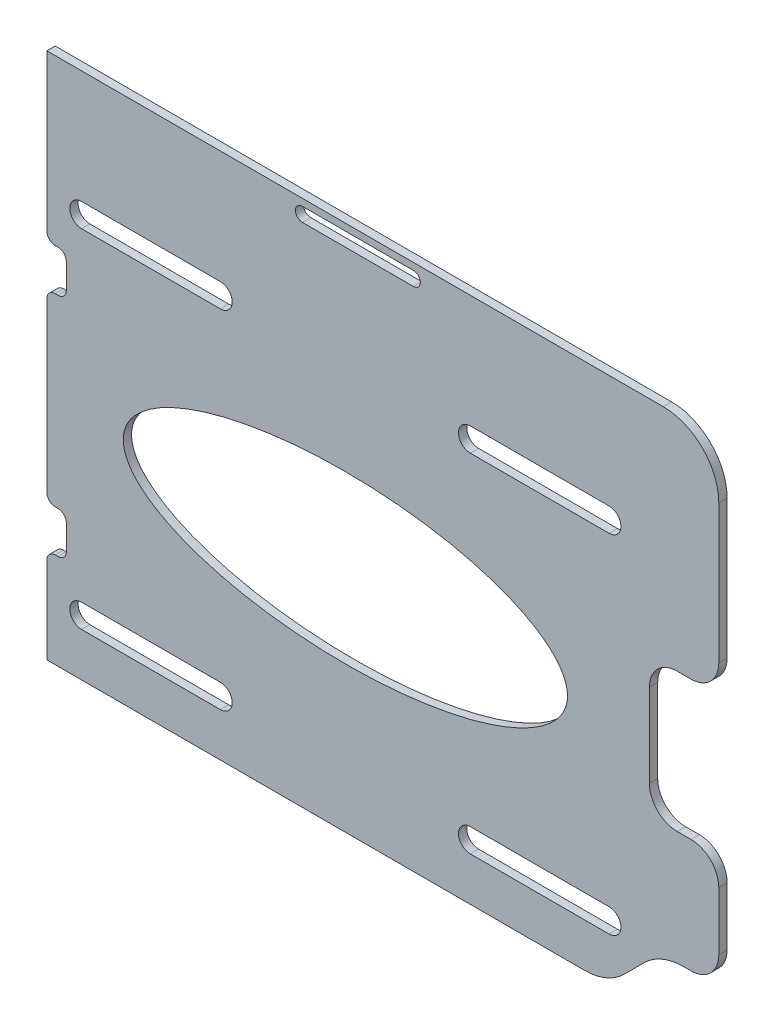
ISO-10303-21;
HEADER;
FILE_DESCRIPTION(('STEP AP214'),'2;1');
FILE_NAME('part.step','',(''),(''),'','','');
FILE_SCHEMA(('AUTOMOTIVE_DESIGN { 1 0 10303 214 1 1 1 1 }'));
ENDSEC;
DATA;
#1=APPLICATION_CONTEXT('core data for automotive mechanical design processes');
#2=APPLICATION_PROTOCOL_DEFINITION('international standard','automotive_design',2000,#1);
#3=PRODUCT_CONTEXT('',#1,'mechanical');
#4=PRODUCT('Part','Part','',(#3));
#5=PRODUCT_RELATED_PRODUCT_CATEGORY('part','',(#4));
#6=PRODUCT_DEFINITION_FORMATION('','',#4);
#7=PRODUCT_DEFINITION_CONTEXT('part definition',#1,'design');
#8=PRODUCT_DEFINITION('design','',#6,#7);
#9=PRODUCT_DEFINITION_SHAPE('','',#8);
#10=(LENGTH_UNIT() NAMED_UNIT(*) SI_UNIT(.MILLI.,.METRE.));
#11=(NAMED_UNIT(*) PLANE_ANGLE_UNIT() SI_UNIT($,.RADIAN.));
#12=(NAMED_UNIT(*) SI_UNIT($,.STERADIAN.) SOLID_ANGLE_UNIT());
#13=UNCERTAINTY_MEASURE_WITH_UNIT(LENGTH_MEASURE(1.E-05),#10,'distance_accuracy_value','');
#14=(GEOMETRIC_REPRESENTATION_CONTEXT(3) GLOBAL_UNCERTAINTY_ASSIGNED_CONTEXT((#13)) GLOBAL_UNIT_ASSIGNED_CONTEXT((#10,
#11,#12)) REPRESENTATION_CONTEXT('',''));
#15=CARTESIAN_POINT('',(0.,0.,0.));
#16=DIRECTION('',(0.,0.,1.));
#17=DIRECTION('',(1.,0.,0.));
#18=AXIS2_PLACEMENT_3D('',#15,#16,#17);
#19=CARTESIAN_POINT('',(-104.5,51.25,3.));
#20=DIRECTION('',(0.,0.,-1.));
#21=DIRECTION('',(-1.,0.,0.));
#22=AXIS2_PLACEMENT_3D('',#19,#20,#21);
#23=PLANE('',#22);
#24=CARTESIAN_POINT('',(45.0000000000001,-62.5,3.));
#25=DIRECTION('',(0.,0.,1.));
#26=DIRECTION('',(1.,0.,0.));
#27=AXIS2_PLACEMENT_3D('',#24,#25,#26);
#28=CIRCLE('',#27,4.25);
#29=CARTESIAN_POINT('',(45.,-58.25,3.));
#30=VERTEX_POINT('',#29);
#31=CARTESIAN_POINT('',(45.,-66.75,3.));
#32=VERTEX_POINT('',#31);
#33=EDGE_CURVE('E417',#30,#32,#28,.T.);
#34=ORIENTED_EDGE('',*,*,#33,.F.);
#35=DIRECTION('',(-1.,0.,0.));
#36=VECTOR('',#35,1.);
#37=CARTESIAN_POINT('',(45.,-58.25,3.));
#38=LINE('',#37,#36);
#39=CARTESIAN_POINT('',(95.,-58.25,3.));
#40=VERTEX_POINT('',#39);
#41=EDGE_CURVE('E424',#40,#30,#38,.T.);
#42=ORIENTED_EDGE('',*,*,#41,.F.);
#43=CARTESIAN_POINT('',(95.0000000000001,-62.5,3.));
#44=DIRECTION('',(0.,0.,1.));
#45=DIRECTION('',(1.,0.,0.));
#46=AXIS2_PLACEMENT_3D('',#43,#44,#45);
#47=CIRCLE('',#46,4.25);
#48=CARTESIAN_POINT('',(95.,-66.75,3.));
#49=VERTEX_POINT('',#48);
#50=EDGE_CURVE('E422',#49,#40,#47,.T.);
#51=ORIENTED_EDGE('',*,*,#50,.F.);
#52=DIRECTION('',(1.,0.,0.));
#53=VECTOR('',#52,1.);
#54=CARTESIAN_POINT('',(45.,-66.75,3.));
#55=LINE('',#54,#53);
#56=EDGE_CURVE('E419',#32,#49,#55,.T.);
#57=ORIENTED_EDGE('',*,*,#56,.F.);
#58=EDGE_LOOP('',(#34,#42,#51,#57));
#59=FACE_BOUND('',#58,.T.);
#60=CARTESIAN_POINT('',(45.,62.5,3.));
#61=DIRECTION('',(0.,0.,1.));
#62=DIRECTION('',(1.,0.,0.));
#63=AXIS2_PLACEMENT_3D('',#60,#61,#62);
#64=CIRCLE('',#63,4.25);
#65=CARTESIAN_POINT('',(45.,66.75,3.));
#66=VERTEX_POINT('',#65);
#67=CARTESIAN_POINT('',(45.,58.25,3.));
#68=VERTEX_POINT('',#67);
#69=EDGE_CURVE('E479',#66,#68,#64,.T.);
#70=ORIENTED_EDGE('',*,*,#69,.F.);
#71=DIRECTION('',(-1.,0.,0.));
#72=VECTOR('',#71,1.);
#73=CARTESIAN_POINT('',(45.,66.75,3.));
#74=LINE('',#73,#72);
#75=CARTESIAN_POINT('',(95.0000000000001,66.75,3.));
#76=VERTEX_POINT('',#75);
#77=EDGE_CURVE('E486',#76,#66,#74,.T.);
#78=ORIENTED_EDGE('',*,*,#77,.F.);
#79=CARTESIAN_POINT('',(95.0000000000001,62.5,3.));
#80=DIRECTION('',(0.,0.,1.));
#81=DIRECTION('',(1.,0.,0.));
#82=AXIS2_PLACEMENT_3D('',#79,#80,#81);
#83=CIRCLE('',#82,4.24999999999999);
#84=CARTESIAN_POINT('',(95.0000000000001,58.25,3.));
#85=VERTEX_POINT('',#84);
#86=EDGE_CURVE('E483',#85,#76,#83,.T.);
#87=ORIENTED_EDGE('',*,*,#86,.F.);
#88=DIRECTION('',(1.,0.,0.));
#89=VECTOR('',#88,1.);
#90=CARTESIAN_POINT('',(45.,58.25,3.));
#91=LINE('',#90,#89);
#92=EDGE_CURVE('E481',#68,#85,#91,.T.);
#93=ORIENTED_EDGE('',*,*,#92,.F.);
#94=EDGE_LOOP('',(#70,#78,#87,#93));
#95=FACE_BOUND('',#94,.T.);
#96=CARTESIAN_POINT('',(0.,0.,3.));
#97=DIRECTION('',(0.,0.,1.));
#98=DIRECTION('',(-1.,0.,0.));
#99=AXIS2_PLACEMENT_3D('',#96,#97,#98);
#100=ELLIPSE('',#99,80.,30.);
#101=CARTESIAN_POINT('',(-80.,0.,3.));
#102=VERTEX_POINT('',#101);
#103=EDGE_CURVE('E532',#102,#102,#100,.T.);
#104=ORIENTED_EDGE('',*,*,#103,.F.);
#105=EDGE_LOOP('',(#104));
#106=FACE_BOUND('',#105,.T.);
#107=DIRECTION('',(0.,-1.,0.));
#108=VECTOR('',#107,1.);
#109=CARTESIAN_POINT('',(-107.5,107.5,3.));
#110=LINE('',#109,#108);
#111=CARTESIAN_POINT('',(-107.5,107.5,3.));
#112=VERTEX_POINT('',#111);
#113=CARTESIAN_POINT('',(-107.5,51.25,3.));
#114=VERTEX_POINT('',#113);
#115=EDGE_CURVE('E767',#112,#114,#110,.T.);
#116=ORIENTED_EDGE('',*,*,#115,.T.);
#117=CARTESIAN_POINT('',(-104.5,51.25,3.));
#118=DIRECTION('',(0.,0.,1.));
#119=DIRECTION('',(-1.,0.,0.));
#120=AXIS2_PLACEMENT_3D('',#117,#118,#119);
#121=CIRCLE('',#120,3.);
#122=CARTESIAN_POINT('',(-104.5,48.25,3.));
#123=VERTEX_POINT('',#122);
#124=EDGE_CURVE('E770',#114,#123,#121,.T.);
#125=ORIENTED_EDGE('',*,*,#124,.T.);
#126=DIRECTION('',(1.,0.,0.));
#127=VECTOR('',#126,1.);
#128=CARTESIAN_POINT('',(-103.5,48.25,3.));
#129=LINE('',#128,#127);
#130=CARTESIAN_POINT('',(-103.5,48.25,3.));
#131=VERTEX_POINT('',#130);
#132=EDGE_CURVE('E698',#123,#131,#129,.T.);
#133=ORIENTED_EDGE('',*,*,#132,.T.);
#134=CARTESIAN_POINT('',(-103.5,45.25,3.));
#135=DIRECTION('',(0.,0.,-1.));
#136=DIRECTION('',(-1.,0.,0.));
#137=AXIS2_PLACEMENT_3D('',#134,#135,#136);
#138=CIRCLE('',#137,3.);
#139=CARTESIAN_POINT('',(-100.5,45.25,3.));
#140=VERTEX_POINT('',#139);
#141=EDGE_CURVE('E773',#131,#140,#138,.T.);
#142=ORIENTED_EDGE('',*,*,#141,.T.);
#143=DIRECTION('',(0.,-1.,0.));
#144=VECTOR('',#143,1.);
#145=CARTESIAN_POINT('',(-100.5,36.25,3.));
#146=LINE('',#145,#144);
#147=CARTESIAN_POINT('',(-100.5,36.25,3.));
#148=VERTEX_POINT('',#147);
#149=EDGE_CURVE('E775',#140,#148,#146,.T.);
#150=ORIENTED_EDGE('',*,*,#149,.T.);
#151=CARTESIAN_POINT('',(-103.5,36.25,3.));
#152=DIRECTION('',(0.,0.,-1.));
#153=DIRECTION('',(-1.,0.,0.));
#154=AXIS2_PLACEMENT_3D('',#151,#152,#153);
#155=CIRCLE('',#154,3.);
#156=CARTESIAN_POINT('',(-103.5,33.25,3.));
#157=VERTEX_POINT('',#156);
#158=EDGE_CURVE('E777',#148,#157,#155,.T.);
#159=ORIENTED_EDGE('',*,*,#158,.T.);
#160=DIRECTION('',(-1.,0.,0.));
#161=VECTOR('',#160,1.);
#162=CARTESIAN_POINT('',(-103.5,33.25,3.));
#163=LINE('',#162,#161);
#164=CARTESIAN_POINT('',(-104.5,33.25,3.));
#165=VERTEX_POINT('',#164);
#166=EDGE_CURVE('E779',#157,#165,#163,.T.);
#167=ORIENTED_EDGE('',*,*,#166,.T.);
#168=CARTESIAN_POINT('',(-104.5,30.25,3.));
#169=DIRECTION('',(0.,0.,1.));
#170=DIRECTION('',(-1.,0.,0.));
#171=AXIS2_PLACEMENT_3D('',#168,#169,#170);
#172=CIRCLE('',#171,3.);
#173=CARTESIAN_POINT('',(-107.5,30.25,3.));
#174=VERTEX_POINT('',#173);
#175=EDGE_CURVE('E781',#165,#174,#172,.T.);
#176=ORIENTED_EDGE('',*,*,#175,.T.);
#177=DIRECTION('',(0.,-1.,0.));
#178=VECTOR('',#177,1.);
#179=CARTESIAN_POINT('',(-107.5,30.25,3.));
#180=LINE('',#179,#178);
#181=CARTESIAN_POINT('',(-107.5,-30.25,3.));
#182=VERTEX_POINT('',#181);
#183=EDGE_CURVE('E783',#174,#182,#180,.T.);
#184=ORIENTED_EDGE('',*,*,#183,.T.);
#185=CARTESIAN_POINT('',(-104.5,-30.25,3.));
#186=DIRECTION('',(0.,0.,1.));
#187=DIRECTION('',(-1.,0.,0.));
#188=AXIS2_PLACEMENT_3D('',#185,#186,#187);
#189=CIRCLE('',#188,3.);
#190=CARTESIAN_POINT('',(-104.5,-33.25,3.));
#191=VERTEX_POINT('',#190);
#192=EDGE_CURVE('E785',#182,#191,#189,.T.);
#193=ORIENTED_EDGE('',*,*,#192,.T.);
#194=DIRECTION('',(1.,0.,0.));
#195=VECTOR('',#194,1.);
#196=CARTESIAN_POINT('',(-103.5,-33.25,3.));
#197=LINE('',#196,#195);
#198=CARTESIAN_POINT('',(-103.5,-33.25,3.));
#199=VERTEX_POINT('',#198);
#200=EDGE_CURVE('E787',#191,#199,#197,.T.);
#201=ORIENTED_EDGE('',*,*,#200,.T.);
#202=CARTESIAN_POINT('',(-103.5,-36.25,3.));
#203=DIRECTION('',(0.,0.,-1.));
#204=DIRECTION('',(1.,0.,0.));
#205=AXIS2_PLACEMENT_3D('',#202,#203,#204);
#206=CIRCLE('',#205,3.);
#207=CARTESIAN_POINT('',(-100.5,-36.25,3.));
#208=VERTEX_POINT('',#207);
#209=EDGE_CURVE('E789',#199,#208,#206,.T.);
#210=ORIENTED_EDGE('',*,*,#209,.T.);
#211=DIRECTION('',(0.,-1.,0.));
#212=VECTOR('',#211,1.);
#213=CARTESIAN_POINT('',(-100.5,-45.25,3.));
#214=LINE('',#213,#212);
#215=CARTESIAN_POINT('',(-100.5,-45.25,3.));
#216=VERTEX_POINT('',#215);
#217=EDGE_CURVE('E791',#208,#216,#214,.T.);
#218=ORIENTED_EDGE('',*,*,#217,.T.);
#219=CARTESIAN_POINT('',(-103.5,-45.25,3.));
#220=DIRECTION('',(0.,0.,-1.));
#221=DIRECTION('',(1.,0.,0.));
#222=AXIS2_PLACEMENT_3D('',#219,#220,#221);
#223=CIRCLE('',#222,3.);
#224=CARTESIAN_POINT('',(-103.5,-48.25,3.));
#225=VERTEX_POINT('',#224);
#226=EDGE_CURVE('E793',#216,#225,#223,.T.);
#227=ORIENTED_EDGE('',*,*,#226,.T.);
#228=DIRECTION('',(-1.,0.,0.));
#229=VECTOR('',#228,1.);
#230=CARTESIAN_POINT('',(-103.5,-48.25,3.));
#231=LINE('',#230,#229);
#232=CARTESIAN_POINT('',(-104.5,-48.25,3.));
#233=VERTEX_POINT('',#232);
#234=EDGE_CURVE('E795',#225,#233,#231,.T.);
#235=ORIENTED_EDGE('',*,*,#234,.T.);
#236=CARTESIAN_POINT('',(-104.5,-51.25,3.));
#237=DIRECTION('',(0.,0.,1.));
#238=DIRECTION('',(-1.,0.,0.));
#239=AXIS2_PLACEMENT_3D('',#236,#237,#238);
#240=CIRCLE('',#239,3.);
#241=CARTESIAN_POINT('',(-107.5,-51.25,3.));
#242=VERTEX_POINT('',#241);
#243=EDGE_CURVE('E797',#233,#242,#240,.T.);
#244=ORIENTED_EDGE('',*,*,#243,.T.);
#245=DIRECTION('',(0.,-1.,0.));
#246=VECTOR('',#245,1.);
#247=CARTESIAN_POINT('',(-107.5,-51.25,3.));
#248=LINE('',#247,#246);
#249=CARTESIAN_POINT('',(-107.5,-82.5,3.));
#250=VERTEX_POINT('',#249);
#251=EDGE_CURVE('E799',#242,#250,#248,.T.);
#252=ORIENTED_EDGE('',*,*,#251,.T.);
#253=DIRECTION('',(1.,0.,0.));
#254=VECTOR('',#253,1.);
#255=CARTESIAN_POINT('',(-107.5,-82.5,3.));
#256=LINE('',#255,#254);
#257=CARTESIAN_POINT('',(86.2157287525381,-82.5,3.));
#258=VERTEX_POINT('',#257);
#259=EDGE_CURVE('E801',#250,#258,#256,.T.);
#260=ORIENTED_EDGE('',*,*,#259,.T.);
#261=CARTESIAN_POINT('',(86.2157287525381,-62.5,3.));
#262=DIRECTION('',(0.,0.,1.));
#263=DIRECTION('',(-1.,0.,0.));
#264=AXIS2_PLACEMENT_3D('',#261,#262,#263);
#265=CIRCLE('',#264,20.);
#266=CARTESIAN_POINT('',(100.357864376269,-76.6421356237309,3.));
#267=VERTEX_POINT('',#266);
#268=EDGE_CURVE('E803',#258,#267,#265,.T.);
#269=ORIENTED_EDGE('',*,*,#268,.T.);
#270=DIRECTION('',(0.70710678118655,0.707106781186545,0.));
#271=VECTOR('',#270,1.);
#272=CARTESIAN_POINT('',(100.357864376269,-76.6421356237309,3.));
#273=LINE('',#272,#271);
#274=CARTESIAN_POINT('',(107.642135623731,-69.357864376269,3.));
#275=VERTEX_POINT('',#274);
#276=EDGE_CURVE('E805',#267,#275,#273,.T.);
#277=ORIENTED_EDGE('',*,*,#276,.T.);
#278=CARTESIAN_POINT('',(121.784271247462,-83.5,3.));
#279=DIRECTION('',(0.,0.,-1.));
#280=DIRECTION('',(-1.,0.,0.));
#281=AXIS2_PLACEMENT_3D('',#278,#279,#280);
#282=CIRCLE('',#281,20.);
#283=CARTESIAN_POINT('',(121.784271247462,-63.5,3.));
#284=VERTEX_POINT('',#283);
#285=EDGE_CURVE('E807',#275,#284,#282,.T.);
#286=ORIENTED_EDGE('',*,*,#285,.T.);
#287=DIRECTION('',(1.,0.,0.));
#288=VECTOR('',#287,1.);
#289=CARTESIAN_POINT('',(121.784271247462,-63.5,3.));
#290=LINE('',#289,#288);
#291=CARTESIAN_POINT('',(124.5,-63.5,3.));
#292=VERTEX_POINT('',#291);
#293=EDGE_CURVE('E809',#284,#292,#290,.T.);
#294=ORIENTED_EDGE('',*,*,#293,.T.);
#295=CARTESIAN_POINT('',(124.5,-53.5,3.));
#296=DIRECTION('',(0.,0.,1.));
#297=DIRECTION('',(1.,0.,0.));
#298=AXIS2_PLACEMENT_3D('',#295,#296,#297);
#299=CIRCLE('',#298,10.);
#300=CARTESIAN_POINT('',(134.5,-53.5,3.));
#301=VERTEX_POINT('',#300);
#302=EDGE_CURVE('E811',#292,#301,#299,.T.);
#303=ORIENTED_EDGE('',*,*,#302,.T.);
#304=DIRECTION('',(0.,1.,0.));
#305=VECTOR('',#304,1.);
#306=CARTESIAN_POINT('',(134.5,-53.5,3.));
#307=LINE('',#306,#305);
#308=CARTESIAN_POINT('',(134.5,-32.5,3.));
#309=VERTEX_POINT('',#308);
#310=EDGE_CURVE('E813',#301,#309,#307,.T.);
#311=ORIENTED_EDGE('',*,*,#310,.T.);
#312=CARTESIAN_POINT('',(124.5,-32.5,3.));
#313=DIRECTION('',(0.,0.,1.));
#314=DIRECTION('',(1.,0.,0.));
#315=AXIS2_PLACEMENT_3D('',#312,#313,#314);
#316=CIRCLE('',#315,9.99999999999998);
#317=CARTESIAN_POINT('',(124.5,-22.5,3.));
#318=VERTEX_POINT('',#317);
#319=EDGE_CURVE('E815',#309,#318,#316,.T.);
#320=ORIENTED_EDGE('',*,*,#319,.T.);
#321=DIRECTION('',(-1.,0.,0.));
#322=VECTOR('',#321,1.);
#323=CARTESIAN_POINT('',(119.5,-22.5,3.));
#324=LINE('',#323,#322);
#325=CARTESIAN_POINT('',(119.5,-22.5,3.));
#326=VERTEX_POINT('',#325);
#327=EDGE_CURVE('E817',#318,#326,#324,.T.);
#328=ORIENTED_EDGE('',*,*,#327,.T.);
#329=CARTESIAN_POINT('',(119.5,-12.5,3.));
#330=DIRECTION('',(0.,0.,-1.));
#331=DIRECTION('',(-1.,0.,0.));
#332=AXIS2_PLACEMENT_3D('',#329,#330,#331);
#333=CIRCLE('',#332,10.);
#334=CARTESIAN_POINT('',(109.5,-12.5,3.));
#335=VERTEX_POINT('',#334);
#336=EDGE_CURVE('E819',#326,#335,#333,.T.);
#337=ORIENTED_EDGE('',*,*,#336,.T.);
#338=DIRECTION('',(0.,1.,0.));
#339=VECTOR('',#338,1.);
#340=CARTESIAN_POINT('',(109.5,17.5,3.));
#341=LINE('',#340,#339);
#342=CARTESIAN_POINT('',(109.5,17.5,3.));
#343=VERTEX_POINT('',#342);
#344=EDGE_CURVE('E821',#335,#343,#341,.T.);
#345=ORIENTED_EDGE('',*,*,#344,.T.);
#346=CARTESIAN_POINT('',(119.5,17.5,3.));
#347=DIRECTION('',(0.,0.,-1.));
#348=DIRECTION('',(-1.,0.,0.));
#349=AXIS2_PLACEMENT_3D('',#346,#347,#348);
#350=CIRCLE('',#349,10.);
#351=CARTESIAN_POINT('',(119.5,27.5,3.));
#352=VERTEX_POINT('',#351);
#353=EDGE_CURVE('E823',#343,#352,#350,.T.);
#354=ORIENTED_EDGE('',*,*,#353,.T.);
#355=DIRECTION('',(1.,0.,0.));
#356=VECTOR('',#355,1.);
#357=CARTESIAN_POINT('',(119.5,27.5,3.));
#358=LINE('',#357,#356);
#359=CARTESIAN_POINT('',(124.5,27.5,3.));
#360=VERTEX_POINT('',#359);
#361=EDGE_CURVE('E825',#352,#360,#358,.T.);
#362=ORIENTED_EDGE('',*,*,#361,.T.);
#363=CARTESIAN_POINT('',(124.5,37.5,3.));
#364=DIRECTION('',(0.,0.,1.));
#365=DIRECTION('',(-1.,0.,0.));
#366=AXIS2_PLACEMENT_3D('',#363,#364,#365);
#367=CIRCLE('',#366,10.);
#368=CARTESIAN_POINT('',(134.5,37.5,3.));
#369=VERTEX_POINT('',#368);
#370=EDGE_CURVE('E827',#360,#369,#367,.T.);
#371=ORIENTED_EDGE('',*,*,#370,.T.);
#372=DIRECTION('',(0.,1.,0.));
#373=VECTOR('',#372,1.);
#374=CARTESIAN_POINT('',(134.5,87.5,3.));
#375=LINE('',#374,#373);
#376=CARTESIAN_POINT('',(134.5,87.5,3.));
#377=VERTEX_POINT('',#376);
#378=EDGE_CURVE('E829',#369,#377,#375,.T.);
#379=ORIENTED_EDGE('',*,*,#378,.T.);
#380=CARTESIAN_POINT('',(114.5,87.5,3.));
#381=DIRECTION('',(0.,0.,1.));
#382=DIRECTION('',(1.,0.,0.));
#383=AXIS2_PLACEMENT_3D('',#380,#381,#382);
#384=CIRCLE('',#383,20.);
#385=CARTESIAN_POINT('',(114.5,107.5,3.));
#386=VERTEX_POINT('',#385);
#387=EDGE_CURVE('E831',#377,#386,#384,.T.);
#388=ORIENTED_EDGE('',*,*,#387,.T.);
#389=DIRECTION('',(-1.,0.,0.));
#390=VECTOR('',#389,1.);
#391=CARTESIAN_POINT('',(114.5,107.5,3.));
#392=LINE('',#391,#390);
#393=EDGE_CURVE('E833',#386,#112,#392,.T.);
#394=ORIENTED_EDGE('',*,*,#393,.T.);
#395=EDGE_LOOP('',(#116,#125,#133,#142,#150,#159,#167,#176,#184,#193,#201,#210,#218,#227,#235,
#244,#252,#260,#269,#277,#286,#294,#303,#311,#320,#328,#337,#345,#354,#362,#371,#379,#388,#394));
#396=FACE_BOUND('',#395,.T.);
#397=DIRECTION('',(1.,0.,0.));
#398=VECTOR('',#397,1.);
#399=CARTESIAN_POINT('',(-95.,58.25,3.));
#400=LINE('',#399,#398);
#401=CARTESIAN_POINT('',(-95.,58.25,3.));
#402=VERTEX_POINT('',#401);
#403=CARTESIAN_POINT('',(-45.,58.25,3.));
#404=VERTEX_POINT('',#403);
#405=EDGE_CURVE('E512',#402,#404,#400,.T.);
#406=ORIENTED_EDGE('',*,*,#405,.F.);
#407=CARTESIAN_POINT('',(-95.,62.5000000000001,3.));
#408=DIRECTION('',(0.,0.,1.));
#409=DIRECTION('',(1.,0.,0.));
#410=AXIS2_PLACEMENT_3D('',#407,#408,#409);
#411=CIRCLE('',#410,4.25);
#412=CARTESIAN_POINT('',(-95.,66.75,3.));
#413=VERTEX_POINT('',#412);
#414=EDGE_CURVE('E510',#413,#402,#411,.T.);
#415=ORIENTED_EDGE('',*,*,#414,.F.);
#416=DIRECTION('',(-1.,0.,0.));
#417=VECTOR('',#416,1.);
#418=CARTESIAN_POINT('',(-95.,66.75,3.));
#419=LINE('',#418,#417);
#420=CARTESIAN_POINT('',(-45.,66.75,3.));
#421=VERTEX_POINT('',#420);
#422=EDGE_CURVE('E517',#421,#413,#419,.T.);
#423=ORIENTED_EDGE('',*,*,#422,.F.);
#424=CARTESIAN_POINT('',(-45.,62.5,3.));
#425=DIRECTION('',(0.,0.,1.));
#426=DIRECTION('',(1.,0.,0.));
#427=AXIS2_PLACEMENT_3D('',#424,#425,#426);
#428=CIRCLE('',#427,4.25);
#429=EDGE_CURVE('E514',#404,#421,#428,.T.);
#430=ORIENTED_EDGE('',*,*,#429,.F.);
#431=EDGE_LOOP('',(#406,#415,#423,#430));
#432=FACE_BOUND('',#431,.T.);
#433=CARTESIAN_POINT('',(-95.,-62.5,3.));
#434=DIRECTION('',(0.,0.,1.));
#435=DIRECTION('',(1.,0.,0.));
#436=AXIS2_PLACEMENT_3D('',#433,#434,#435);
#437=CIRCLE('',#436,4.24999999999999);
#438=CARTESIAN_POINT('',(-95.,-58.25,3.));
#439=VERTEX_POINT('',#438);
#440=CARTESIAN_POINT('',(-95.,-66.75,3.));
#441=VERTEX_POINT('',#440);
#442=EDGE_CURVE('E448',#439,#441,#437,.T.);
#443=ORIENTED_EDGE('',*,*,#442,.F.);
#444=DIRECTION('',(-1.,0.,0.));
#445=VECTOR('',#444,1.);
#446=CARTESIAN_POINT('',(-95.,-58.25,3.));
#447=LINE('',#446,#445);
#448=CARTESIAN_POINT('',(-45.,-58.25,3.));
#449=VERTEX_POINT('',#448);
#450=EDGE_CURVE('E455',#449,#439,#447,.T.);
#451=ORIENTED_EDGE('',*,*,#450,.F.);
#452=CARTESIAN_POINT('',(-45.,-62.5,3.));
#453=DIRECTION('',(0.,0.,1.));
#454=DIRECTION('',(1.,0.,0.));
#455=AXIS2_PLACEMENT_3D('',#452,#453,#454);
#456=CIRCLE('',#455,4.24999999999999);
#457=CARTESIAN_POINT('',(-45.,-66.75,3.));
#458=VERTEX_POINT('',#457);
#459=EDGE_CURVE('E452',#458,#449,#456,.T.);
#460=ORIENTED_EDGE('',*,*,#459,.F.);
#461=DIRECTION('',(1.,0.,0.));
#462=VECTOR('',#461,1.);
#463=CARTESIAN_POINT('',(-95.,-66.75,3.));
#464=LINE('',#463,#462);
#465=EDGE_CURVE('E450',#441,#458,#464,.T.);
#466=ORIENTED_EDGE('',*,*,#465,.F.);
#467=EDGE_LOOP('',(#443,#451,#460,#466));
#468=FACE_BOUND('',#467,.T.);
#469=CARTESIAN_POINT('',(-15.5000000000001,102.5,3.));
#470=DIRECTION('',(0.,0.,1.));
#471=DIRECTION('',(1.,0.,0.));
#472=AXIS2_PLACEMENT_3D('',#469,#470,#471);
#473=CIRCLE('',#472,2.5);
#474=CARTESIAN_POINT('',(-15.5000000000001,105.,3.));
#475=VERTEX_POINT('',#474);
#476=CARTESIAN_POINT('',(-15.5,100.,3.));
#477=VERTEX_POINT('',#476);
#478=EDGE_CURVE('E383',#475,#477,#473,.T.);
#479=ORIENTED_EDGE('',*,*,#478,.F.);
#480=DIRECTION('',(-1.,0.,0.));
#481=VECTOR('',#480,1.);
#482=CARTESIAN_POINT('',(-15.5000000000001,105.,3.));
#483=LINE('',#482,#481);
#484=CARTESIAN_POINT('',(24.5,105.,3.));
#485=VERTEX_POINT('',#484);
#486=EDGE_CURVE('E399',#485,#475,#483,.T.);
#487=ORIENTED_EDGE('',*,*,#486,.F.);
#488=CARTESIAN_POINT('',(24.5,102.5,3.));
#489=DIRECTION('',(0.,0.,1.));
#490=DIRECTION('',(1.,0.,0.));
#491=AXIS2_PLACEMENT_3D('',#488,#489,#490);
#492=CIRCLE('',#491,2.5);
#493=CARTESIAN_POINT('',(24.5,100.,3.));
#494=VERTEX_POINT('',#493);
#495=EDGE_CURVE('E397',#494,#485,#492,.T.);
#496=ORIENTED_EDGE('',*,*,#495,.F.);
#497=DIRECTION('',(1.,0.,0.));
#498=VECTOR('',#497,1.);
#499=CARTESIAN_POINT('',(-15.5,100.,3.));
#500=LINE('',#499,#498);
#501=EDGE_CURVE('E395',#477,#494,#500,.T.);
#502=ORIENTED_EDGE('',*,*,#501,.F.);
#503=EDGE_LOOP('',(#479,#487,#496,#502));
#504=FACE_BOUND('',#503,.T.);
#505=ADVANCED_FACE('F30',(#59,#95,#106,#396,#432,#468,#504),#23,.F.);
#506=CARTESIAN_POINT('',(-104.5,51.25,0.));
#507=DIRECTION('',(0.,0.,-1.));
#508=DIRECTION('',(-1.,0.,0.));
#509=AXIS2_PLACEMENT_3D('',#506,#507,#508);
#510=PLANE('',#509);
#511=DIRECTION('',(-1.,0.,0.));
#512=VECTOR('',#511,1.);
#513=CARTESIAN_POINT('',(45.,-58.25,0.));
#514=LINE('',#513,#512);
#515=CARTESIAN_POINT('',(95.,-58.25,0.));
#516=VERTEX_POINT('',#515);
#517=CARTESIAN_POINT('',(45.,-58.25,0.));
#518=VERTEX_POINT('',#517);
#519=EDGE_CURVE('E414',#516,#518,#514,.T.);
#520=ORIENTED_EDGE('',*,*,#519,.T.);
#521=CARTESIAN_POINT('',(45.0000000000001,-62.5,0.));
#522=DIRECTION('',(0.,0.,1.));
#523=DIRECTION('',(1.,0.,0.));
#524=AXIS2_PLACEMENT_3D('',#521,#522,#523);
#525=CIRCLE('',#524,4.25);
#526=CARTESIAN_POINT('',(45.,-66.75,0.));
#527=VERTEX_POINT('',#526);
#528=EDGE_CURVE('E384',#518,#527,#525,.T.);
#529=ORIENTED_EDGE('',*,*,#528,.T.);
#530=DIRECTION('',(1.,0.,0.));
#531=VECTOR('',#530,1.);
#532=CARTESIAN_POINT('',(45.,-66.75,0.));
#533=LINE('',#532,#531);
#534=CARTESIAN_POINT('',(95.,-66.75,0.));
#535=VERTEX_POINT('',#534);
#536=EDGE_CURVE('E408',#527,#535,#533,.T.);
#537=ORIENTED_EDGE('',*,*,#536,.T.);
#538=CARTESIAN_POINT('',(95.0000000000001,-62.5,0.));
#539=DIRECTION('',(0.,0.,1.));
#540=DIRECTION('',(1.,0.,0.));
#541=AXIS2_PLACEMENT_3D('',#538,#539,#540);
#542=CIRCLE('',#541,4.25);
#543=EDGE_CURVE('E411',#535,#516,#542,.T.);
#544=ORIENTED_EDGE('',*,*,#543,.T.);
#545=EDGE_LOOP('',(#520,#529,#537,#544));
#546=FACE_BOUND('',#545,.T.);
#547=DIRECTION('',(-1.,0.,0.));
#548=VECTOR('',#547,1.);
#549=CARTESIAN_POINT('',(45.,66.75,0.));
#550=LINE('',#549,#548);
#551=CARTESIAN_POINT('',(95.0000000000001,66.75,0.));
#552=VERTEX_POINT('',#551);
#553=CARTESIAN_POINT('',(45.0000000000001,66.75,0.));
#554=VERTEX_POINT('',#553);
#555=EDGE_CURVE('E476',#552,#554,#550,.T.);
#556=ORIENTED_EDGE('',*,*,#555,.T.);
#557=CARTESIAN_POINT('',(45.,62.5,0.));
#558=DIRECTION('',(0.,0.,1.));
#559=DIRECTION('',(1.,0.,0.));
#560=AXIS2_PLACEMENT_3D('',#557,#558,#559);
#561=CIRCLE('',#560,4.25);
#562=CARTESIAN_POINT('',(45.,58.25,0.));
#563=VERTEX_POINT('',#562);
#564=EDGE_CURVE('E467',#554,#563,#561,.T.);
#565=ORIENTED_EDGE('',*,*,#564,.T.);
#566=DIRECTION('',(1.,0.,0.));
#567=VECTOR('',#566,1.);
#568=CARTESIAN_POINT('',(45.,58.25,0.));
#569=LINE('',#568,#567);
#570=CARTESIAN_POINT('',(95.0000000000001,58.25,0.));
#571=VERTEX_POINT('',#570);
#572=EDGE_CURVE('E470',#563,#571,#569,.T.);
#573=ORIENTED_EDGE('',*,*,#572,.T.);
#574=CARTESIAN_POINT('',(95.0000000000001,62.5,0.));
#575=DIRECTION('',(0.,0.,1.));
#576=DIRECTION('',(1.,0.,0.));
#577=AXIS2_PLACEMENT_3D('',#574,#575,#576);
#578=CIRCLE('',#577,4.24999999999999);
#579=EDGE_CURVE('E473',#571,#552,#578,.T.);
#580=ORIENTED_EDGE('',*,*,#579,.T.);
#581=EDGE_LOOP('',(#556,#565,#573,#580));
#582=FACE_BOUND('',#581,.T.);
#583=CARTESIAN_POINT('',(0.,0.,0.));
#584=DIRECTION('',(0.,0.,1.));
#585=DIRECTION('',(-1.,0.,0.));
#586=AXIS2_PLACEMENT_3D('',#583,#584,#585);
#587=ELLIPSE('',#586,80.,30.);
#588=CARTESIAN_POINT('',(-80.,0.,0.));
#589=VERTEX_POINT('',#588);
#590=EDGE_CURVE('E529',#589,#589,#587,.T.);
#591=ORIENTED_EDGE('',*,*,#590,.T.);
#592=EDGE_LOOP('',(#591));
#593=FACE_BOUND('',#592,.T.);
#594=DIRECTION('',(0.,-1.,0.));
#595=VECTOR('',#594,1.);
#596=CARTESIAN_POINT('',(-107.5,107.5,0.));
#597=LINE('',#596,#595);
#598=CARTESIAN_POINT('',(-107.5,107.5,0.));
#599=VERTEX_POINT('',#598);
#600=CARTESIAN_POINT('',(-107.5,51.25,0.));
#601=VERTEX_POINT('',#600);
#602=EDGE_CURVE('E536',#599,#601,#597,.T.);
#603=ORIENTED_EDGE('',*,*,#602,.F.);
#604=DIRECTION('',(-1.,0.,0.));
#605=VECTOR('',#604,1.);
#606=CARTESIAN_POINT('',(114.5,107.5,0.));
#607=LINE('',#606,#605);
#608=CARTESIAN_POINT('',(114.5,107.5,0.));
#609=VERTEX_POINT('',#608);
#610=EDGE_CURVE('E765',#609,#599,#607,.T.);
#611=ORIENTED_EDGE('',*,*,#610,.F.);
#612=CARTESIAN_POINT('',(114.5,87.5,0.));
#613=DIRECTION('',(0.,0.,1.));
#614=DIRECTION('',(1.,0.,0.));
#615=AXIS2_PLACEMENT_3D('',#612,#613,#614);
#616=CIRCLE('',#615,20.);
#617=CARTESIAN_POINT('',(134.5,87.5,0.));
#618=VERTEX_POINT('',#617);
#619=EDGE_CURVE('E763',#618,#609,#616,.T.);
#620=ORIENTED_EDGE('',*,*,#619,.F.);
#621=DIRECTION('',(0.,1.,0.));
#622=VECTOR('',#621,1.);
#623=CARTESIAN_POINT('',(134.5,87.5,0.));
#624=LINE('',#623,#622);
#625=CARTESIAN_POINT('',(134.5,37.5,0.));
#626=VERTEX_POINT('',#625);
#627=EDGE_CURVE('E761',#626,#618,#624,.T.);
#628=ORIENTED_EDGE('',*,*,#627,.F.);
#629=CARTESIAN_POINT('',(124.5,37.5,0.));
#630=DIRECTION('',(0.,0.,1.));
#631=DIRECTION('',(-1.,0.,0.));
#632=AXIS2_PLACEMENT_3D('',#629,#630,#631);
#633=CIRCLE('',#632,10.);
#634=CARTESIAN_POINT('',(124.5,27.5,0.));
#635=VERTEX_POINT('',#634);
#636=EDGE_CURVE('E759',#635,#626,#633,.T.);
#637=ORIENTED_EDGE('',*,*,#636,.F.);
#638=DIRECTION('',(1.,0.,0.));
#639=VECTOR('',#638,1.);
#640=CARTESIAN_POINT('',(119.5,27.5,0.));
#641=LINE('',#640,#639);
#642=CARTESIAN_POINT('',(119.5,27.5,0.));
#643=VERTEX_POINT('',#642);
#644=EDGE_CURVE('E757',#643,#635,#641,.T.);
#645=ORIENTED_EDGE('',*,*,#644,.F.);
#646=CARTESIAN_POINT('',(119.5,17.5,0.));
#647=DIRECTION('',(0.,0.,-1.));
#648=DIRECTION('',(-1.,0.,0.));
#649=AXIS2_PLACEMENT_3D('',#646,#647,#648);
#650=CIRCLE('',#649,10.);
#651=CARTESIAN_POINT('',(109.5,17.5,0.));
#652=VERTEX_POINT('',#651);
#653=EDGE_CURVE('E755',#652,#643,#650,.T.);
#654=ORIENTED_EDGE('',*,*,#653,.F.);
#655=DIRECTION('',(0.,1.,0.));
#656=VECTOR('',#655,1.);
#657=CARTESIAN_POINT('',(109.5,17.5,0.));
#658=LINE('',#657,#656);
#659=CARTESIAN_POINT('',(109.5,-12.5,0.));
#660=VERTEX_POINT('',#659);
#661=EDGE_CURVE('E753',#660,#652,#658,.T.);
#662=ORIENTED_EDGE('',*,*,#661,.F.);
#663=CARTESIAN_POINT('',(119.5,-12.5,0.));
#664=DIRECTION('',(0.,0.,-1.));
#665=DIRECTION('',(-1.,0.,0.));
#666=AXIS2_PLACEMENT_3D('',#663,#664,#665);
#667=CIRCLE('',#666,10.);
#668=CARTESIAN_POINT('',(119.5,-22.5,0.));
#669=VERTEX_POINT('',#668);
#670=EDGE_CURVE('E751',#669,#660,#667,.T.);
#671=ORIENTED_EDGE('',*,*,#670,.F.);
#672=DIRECTION('',(-1.,0.,0.));
#673=VECTOR('',#672,1.);
#674=CARTESIAN_POINT('',(119.5,-22.5,0.));
#675=LINE('',#674,#673);
#676=CARTESIAN_POINT('',(124.5,-22.5,0.));
#677=VERTEX_POINT('',#676);
#678=EDGE_CURVE('E749',#677,#669,#675,.T.);
#679=ORIENTED_EDGE('',*,*,#678,.F.);
#680=CARTESIAN_POINT('',(124.5,-32.5,0.));
#681=DIRECTION('',(0.,0.,1.));
#682=DIRECTION('',(1.,0.,0.));
#683=AXIS2_PLACEMENT_3D('',#680,#681,#682);
#684=CIRCLE('',#683,9.99999999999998);
#685=CARTESIAN_POINT('',(134.5,-32.5,0.));
#686=VERTEX_POINT('',#685);
#687=EDGE_CURVE('E747',#686,#677,#684,.T.);
#688=ORIENTED_EDGE('',*,*,#687,.F.);
#689=DIRECTION('',(0.,1.,0.));
#690=VECTOR('',#689,1.);
#691=CARTESIAN_POINT('',(134.5,-53.5,0.));
#692=LINE('',#691,#690);
#693=CARTESIAN_POINT('',(134.5,-53.5,0.));
#694=VERTEX_POINT('',#693);
#695=EDGE_CURVE('E745',#694,#686,#692,.T.);
#696=ORIENTED_EDGE('',*,*,#695,.F.);
#697=CARTESIAN_POINT('',(124.5,-53.5,0.));
#698=DIRECTION('',(0.,0.,1.));
#699=DIRECTION('',(1.,0.,0.));
#700=AXIS2_PLACEMENT_3D('',#697,#698,#699);
#701=CIRCLE('',#700,10.);
#702=CARTESIAN_POINT('',(124.5,-63.5,0.));
#703=VERTEX_POINT('',#702);
#704=EDGE_CURVE('E743',#703,#694,#701,.T.);
#705=ORIENTED_EDGE('',*,*,#704,.F.);
#706=DIRECTION('',(1.,0.,0.));
#707=VECTOR('',#706,1.);
#708=CARTESIAN_POINT('',(121.784271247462,-63.5,0.));
#709=LINE('',#708,#707);
#710=CARTESIAN_POINT('',(121.784271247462,-63.5,0.));
#711=VERTEX_POINT('',#710);
#712=EDGE_CURVE('E741',#711,#703,#709,.T.);
#713=ORIENTED_EDGE('',*,*,#712,.F.);
#714=CARTESIAN_POINT('',(121.784271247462,-83.5,0.));
#715=DIRECTION('',(0.,0.,-1.));
#716=DIRECTION('',(-1.,0.,0.));
#717=AXIS2_PLACEMENT_3D('',#714,#715,#716);
#718=CIRCLE('',#717,20.);
#719=CARTESIAN_POINT('',(107.642135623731,-69.357864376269,0.));
#720=VERTEX_POINT('',#719);
#721=EDGE_CURVE('E739',#720,#711,#718,.T.);
#722=ORIENTED_EDGE('',*,*,#721,.F.);
#723=DIRECTION('',(0.70710678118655,0.707106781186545,0.));
#724=VECTOR('',#723,1.);
#725=CARTESIAN_POINT('',(100.357864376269,-76.6421356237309,0.));
#726=LINE('',#725,#724);
#727=CARTESIAN_POINT('',(100.357864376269,-76.6421356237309,0.));
#728=VERTEX_POINT('',#727);
#729=EDGE_CURVE('E737',#728,#720,#726,.T.);
#730=ORIENTED_EDGE('',*,*,#729,.F.);
#731=CARTESIAN_POINT('',(86.2157287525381,-62.5,0.));
#732=DIRECTION('',(0.,0.,1.));
#733=DIRECTION('',(-1.,0.,0.));
#734=AXIS2_PLACEMENT_3D('',#731,#732,#733);
#735=CIRCLE('',#734,20.);
#736=CARTESIAN_POINT('',(86.2157287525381,-82.5,0.));
#737=VERTEX_POINT('',#736);
#738=EDGE_CURVE('E735',#737,#728,#735,.T.);
#739=ORIENTED_EDGE('',*,*,#738,.F.);
#740=DIRECTION('',(1.,0.,0.));
#741=VECTOR('',#740,1.);
#742=CARTESIAN_POINT('',(-107.5,-82.5,0.));
#743=LINE('',#742,#741);
#744=CARTESIAN_POINT('',(-107.5,-82.5,0.));
#745=VERTEX_POINT('',#744);
#746=EDGE_CURVE('E733',#745,#737,#743,.T.);
#747=ORIENTED_EDGE('',*,*,#746,.F.);
#748=DIRECTION('',(0.,-1.,0.));
#749=VECTOR('',#748,1.);
#750=CARTESIAN_POINT('',(-107.5,-51.25,0.));
#751=LINE('',#750,#749);
#752=CARTESIAN_POINT('',(-107.5,-51.25,0.));
#753=VERTEX_POINT('',#752);
#754=EDGE_CURVE('E731',#753,#745,#751,.T.);
#755=ORIENTED_EDGE('',*,*,#754,.F.);
#756=CARTESIAN_POINT('',(-104.5,-51.25,0.));
#757=DIRECTION('',(0.,0.,1.));
#758=DIRECTION('',(-1.,0.,0.));
#759=AXIS2_PLACEMENT_3D('',#756,#757,#758);
#760=CIRCLE('',#759,3.);
#761=CARTESIAN_POINT('',(-104.5,-48.25,0.));
#762=VERTEX_POINT('',#761);
#763=EDGE_CURVE('E729',#762,#753,#760,.T.);
#764=ORIENTED_EDGE('',*,*,#763,.F.);
#765=DIRECTION('',(-1.,0.,0.));
#766=VECTOR('',#765,1.);
#767=CARTESIAN_POINT('',(-103.5,-48.25,0.));
#768=LINE('',#767,#766);
#769=CARTESIAN_POINT('',(-103.5,-48.25,0.));
#770=VERTEX_POINT('',#769);
#771=EDGE_CURVE('E727',#770,#762,#768,.T.);
#772=ORIENTED_EDGE('',*,*,#771,.F.);
#773=CARTESIAN_POINT('',(-103.5,-45.25,0.));
#774=DIRECTION('',(0.,0.,-1.));
#775=DIRECTION('',(1.,0.,0.));
#776=AXIS2_PLACEMENT_3D('',#773,#774,#775);
#777=CIRCLE('',#776,3.);
#778=CARTESIAN_POINT('',(-100.5,-45.25,0.));
#779=VERTEX_POINT('',#778);
#780=EDGE_CURVE('E725',#779,#770,#777,.T.);
#781=ORIENTED_EDGE('',*,*,#780,.F.);
#782=DIRECTION('',(0.,-1.,0.));
#783=VECTOR('',#782,1.);
#784=CARTESIAN_POINT('',(-100.5,-45.25,0.));
#785=LINE('',#784,#783);
#786=CARTESIAN_POINT('',(-100.5,-36.25,0.));
#787=VERTEX_POINT('',#786);
#788=EDGE_CURVE('E723',#787,#779,#785,.T.);
#789=ORIENTED_EDGE('',*,*,#788,.F.);
#790=CARTESIAN_POINT('',(-103.5,-36.25,0.));
#791=DIRECTION('',(0.,0.,-1.));
#792=DIRECTION('',(1.,0.,0.));
#793=AXIS2_PLACEMENT_3D('',#790,#791,#792);
#794=CIRCLE('',#793,3.);
#795=CARTESIAN_POINT('',(-103.5,-33.25,0.));
#796=VERTEX_POINT('',#795);
#797=EDGE_CURVE('E721',#796,#787,#794,.T.);
#798=ORIENTED_EDGE('',*,*,#797,.F.);
#799=DIRECTION('',(1.,0.,0.));
#800=VECTOR('',#799,1.);
#801=CARTESIAN_POINT('',(-103.5,-33.25,0.));
#802=LINE('',#801,#800);
#803=CARTESIAN_POINT('',(-104.5,-33.25,0.));
#804=VERTEX_POINT('',#803);
#805=EDGE_CURVE('E719',#804,#796,#802,.T.);
#806=ORIENTED_EDGE('',*,*,#805,.F.);
#807=CARTESIAN_POINT('',(-104.5,-30.25,0.));
#808=DIRECTION('',(0.,0.,1.));
#809=DIRECTION('',(-1.,0.,0.));
#810=AXIS2_PLACEMENT_3D('',#807,#808,#809);
#811=CIRCLE('',#810,3.);
#812=CARTESIAN_POINT('',(-107.5,-30.25,0.));
#813=VERTEX_POINT('',#812);
#814=EDGE_CURVE('E717',#813,#804,#811,.T.);
#815=ORIENTED_EDGE('',*,*,#814,.F.);
#816=DIRECTION('',(0.,-1.,0.));
#817=VECTOR('',#816,1.);
#818=CARTESIAN_POINT('',(-107.5,30.25,0.));
#819=LINE('',#818,#817);
#820=CARTESIAN_POINT('',(-107.5,30.25,0.));
#821=VERTEX_POINT('',#820);
#822=EDGE_CURVE('E715',#821,#813,#819,.T.);
#823=ORIENTED_EDGE('',*,*,#822,.F.);
#824=CARTESIAN_POINT('',(-104.5,30.25,0.));
#825=DIRECTION('',(0.,0.,1.));
#826=DIRECTION('',(-1.,0.,0.));
#827=AXIS2_PLACEMENT_3D('',#824,#825,#826);
#828=CIRCLE('',#827,3.);
#829=CARTESIAN_POINT('',(-104.5,33.25,0.));
#830=VERTEX_POINT('',#829);
#831=EDGE_CURVE('E713',#830,#821,#828,.T.);
#832=ORIENTED_EDGE('',*,*,#831,.F.);
#833=DIRECTION('',(-1.,0.,0.));
#834=VECTOR('',#833,1.);
#835=CARTESIAN_POINT('',(-103.5,33.25,0.));
#836=LINE('',#835,#834);
#837=CARTESIAN_POINT('',(-103.5,33.25,0.));
#838=VERTEX_POINT('',#837);
#839=EDGE_CURVE('E711',#838,#830,#836,.T.);
#840=ORIENTED_EDGE('',*,*,#839,.F.);
#841=CARTESIAN_POINT('',(-103.5,36.25,0.));
#842=DIRECTION('',(0.,0.,-1.));
#843=DIRECTION('',(-1.,0.,0.));
#844=AXIS2_PLACEMENT_3D('',#841,#842,#843);
#845=CIRCLE('',#844,3.);
#846=CARTESIAN_POINT('',(-100.5,36.25,0.));
#847=VERTEX_POINT('',#846);
#848=EDGE_CURVE('E709',#847,#838,#845,.T.);
#849=ORIENTED_EDGE('',*,*,#848,.F.);
#850=DIRECTION('',(0.,-1.,0.));
#851=VECTOR('',#850,1.);
#852=CARTESIAN_POINT('',(-100.5,36.25,0.));
#853=LINE('',#852,#851);
#854=CARTESIAN_POINT('',(-100.5,45.25,0.));
#855=VERTEX_POINT('',#854);
#856=EDGE_CURVE('E705',#855,#847,#853,.T.);
#857=ORIENTED_EDGE('',*,*,#856,.F.);
#858=CARTESIAN_POINT('',(-103.5,45.25,0.));
#859=DIRECTION('',(0.,0.,-1.));
#860=DIRECTION('',(-1.,0.,0.));
#861=AXIS2_PLACEMENT_3D('',#858,#859,#860);
#862=CIRCLE('',#861,3.);
#863=CARTESIAN_POINT('',(-103.5,48.25,0.));
#864=VERTEX_POINT('',#863);
#865=EDGE_CURVE('E703',#864,#855,#862,.T.);
#866=ORIENTED_EDGE('',*,*,#865,.F.);
#867=DIRECTION('',(1.,0.,0.));
#868=VECTOR('',#867,1.);
#869=CARTESIAN_POINT('',(-103.5,48.25,0.));
#870=LINE('',#869,#868);
#871=CARTESIAN_POINT('',(-104.5,48.25,0.));
#872=VERTEX_POINT('',#871);
#873=EDGE_CURVE('E695',#872,#864,#870,.T.);
#874=ORIENTED_EDGE('',*,*,#873,.F.);
#875=CARTESIAN_POINT('',(-104.5,51.25,0.));
#876=DIRECTION('',(0.,0.,1.));
#877=DIRECTION('',(-1.,0.,0.));
#878=AXIS2_PLACEMENT_3D('',#875,#876,#877);
#879=CIRCLE('',#878,3.);
#880=EDGE_CURVE('E687',#601,#872,#879,.T.);
#881=ORIENTED_EDGE('',*,*,#880,.F.);
#882=EDGE_LOOP('',(#603,#611,#620,#628,#637,#645,#654,#662,#671,#679,#688,#696,#705,#713,#722,
#730,#739,#747,#755,#764,#772,#781,#789,#798,#806,#815,#823,#832,#840,#849,#857,#866,#874,#881));
#883=FACE_BOUND('',#882,.T.);
#884=DIRECTION('',(-1.,0.,0.));
#885=VECTOR('',#884,1.);
#886=CARTESIAN_POINT('',(-95.,66.75,0.));
#887=LINE('',#886,#885);
#888=CARTESIAN_POINT('',(-45.,66.75,0.));
#889=VERTEX_POINT('',#888);
#890=CARTESIAN_POINT('',(-95.,66.75,0.));
#891=VERTEX_POINT('',#890);
#892=EDGE_CURVE('E507',#889,#891,#887,.T.);
#893=ORIENTED_EDGE('',*,*,#892,.T.);
#894=CARTESIAN_POINT('',(-95.,62.5000000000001,0.));
#895=DIRECTION('',(0.,0.,1.));
#896=DIRECTION('',(1.,0.,0.));
#897=AXIS2_PLACEMENT_3D('',#894,#895,#896);
#898=CIRCLE('',#897,4.25);
#899=CARTESIAN_POINT('',(-95.,58.25,0.));
#900=VERTEX_POINT('',#899);
#901=EDGE_CURVE('E498',#891,#900,#898,.T.);
#902=ORIENTED_EDGE('',*,*,#901,.T.);
#903=DIRECTION('',(1.,0.,0.));
#904=VECTOR('',#903,1.);
#905=CARTESIAN_POINT('',(-95.,58.25,0.));
#906=LINE('',#905,#904);
#907=CARTESIAN_POINT('',(-45.,58.25,0.));
#908=VERTEX_POINT('',#907);
#909=EDGE_CURVE('E501',#900,#908,#906,.T.);
#910=ORIENTED_EDGE('',*,*,#909,.T.);
#911=CARTESIAN_POINT('',(-45.,62.5,0.));
#912=DIRECTION('',(0.,0.,1.));
#913=DIRECTION('',(1.,0.,0.));
#914=AXIS2_PLACEMENT_3D('',#911,#912,#913);
#915=CIRCLE('',#914,4.25);
#916=EDGE_CURVE('E504',#908,#889,#915,.T.);
#917=ORIENTED_EDGE('',*,*,#916,.T.);
#918=EDGE_LOOP('',(#893,#902,#910,#917));
#919=FACE_BOUND('',#918,.T.);
#920=DIRECTION('',(-1.,0.,0.));
#921=VECTOR('',#920,1.);
#922=CARTESIAN_POINT('',(-95.,-58.25,0.));
#923=LINE('',#922,#921);
#924=CARTESIAN_POINT('',(-45.,-58.25,0.));
#925=VERTEX_POINT('',#924);
#926=CARTESIAN_POINT('',(-95.,-58.25,0.));
#927=VERTEX_POINT('',#926);
#928=EDGE_CURVE('E445',#925,#927,#923,.T.);
#929=ORIENTED_EDGE('',*,*,#928,.T.);
#930=CARTESIAN_POINT('',(-95.,-62.5,0.));
#931=DIRECTION('',(0.,0.,1.));
#932=DIRECTION('',(1.,0.,0.));
#933=AXIS2_PLACEMENT_3D('',#930,#931,#932);
#934=CIRCLE('',#933,4.24999999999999);
#935=CARTESIAN_POINT('',(-95.,-66.75,0.));
#936=VERTEX_POINT('',#935);
#937=EDGE_CURVE('E436',#927,#936,#934,.T.);
#938=ORIENTED_EDGE('',*,*,#937,.T.);
#939=DIRECTION('',(1.,0.,0.));
#940=VECTOR('',#939,1.);
#941=CARTESIAN_POINT('',(-95.,-66.75,0.));
#942=LINE('',#941,#940);
#943=CARTESIAN_POINT('',(-45.,-66.75,0.));
#944=VERTEX_POINT('',#943);
#945=EDGE_CURVE('E439',#936,#944,#942,.T.);
#946=ORIENTED_EDGE('',*,*,#945,.T.);
#947=CARTESIAN_POINT('',(-45.,-62.5,0.));
#948=DIRECTION('',(0.,0.,1.));
#949=DIRECTION('',(1.,0.,0.));
#950=AXIS2_PLACEMENT_3D('',#947,#948,#949);
#951=CIRCLE('',#950,4.24999999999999);
#952=EDGE_CURVE('E442',#944,#925,#951,.T.);
#953=ORIENTED_EDGE('',*,*,#952,.T.);
#954=EDGE_LOOP('',(#929,#938,#946,#953));
#955=FACE_BOUND('',#954,.T.);
#956=CARTESIAN_POINT('',(-15.5000000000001,102.5,0.));
#957=DIRECTION('',(0.,0.,1.));
#958=DIRECTION('',(1.,0.,0.));
#959=AXIS2_PLACEMENT_3D('',#956,#957,#958);
#960=CIRCLE('',#959,2.5);
#961=CARTESIAN_POINT('',(-15.5000000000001,105.,0.));
#962=VERTEX_POINT('',#961);
#963=CARTESIAN_POINT('',(-15.5,100.,0.));
#964=VERTEX_POINT('',#963);
#965=EDGE_CURVE('E53',#962,#964,#960,.T.);
#966=ORIENTED_EDGE('',*,*,#965,.T.);
#967=DIRECTION('',(1.,0.,0.));
#968=VECTOR('',#967,1.);
#969=CARTESIAN_POINT('',(-15.5,100.,0.));
#970=LINE('',#969,#968);
#971=CARTESIAN_POINT('',(24.5,100.,0.));
#972=VERTEX_POINT('',#971);
#973=EDGE_CURVE('E373',#964,#972,#970,.T.);
#974=ORIENTED_EDGE('',*,*,#973,.T.);
#975=CARTESIAN_POINT('',(24.5,102.5,0.));
#976=DIRECTION('',(0.,0.,1.));
#977=DIRECTION('',(1.,0.,0.));
#978=AXIS2_PLACEMENT_3D('',#975,#976,#977);
#979=CIRCLE('',#978,2.5);
#980=CARTESIAN_POINT('',(24.5,105.,0.));
#981=VERTEX_POINT('',#980);
#982=EDGE_CURVE('E379',#972,#981,#979,.T.);
#983=ORIENTED_EDGE('',*,*,#982,.T.);
#984=DIRECTION('',(-1.,0.,0.));
#985=VECTOR('',#984,1.);
#986=CARTESIAN_POINT('',(-15.5000000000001,105.,0.));
#987=LINE('',#986,#985);
#988=EDGE_CURVE('E389',#981,#962,#987,.T.);
#989=ORIENTED_EDGE('',*,*,#988,.T.);
#990=EDGE_LOOP('',(#966,#974,#983,#989));
#991=FACE_BOUND('',#990,.T.);
#992=ADVANCED_FACE('F387',(#546,#582,#593,#883,#919,#955,#991),#510,.T.);
#993=CARTESIAN_POINT('',(-107.5,107.5,3.));
#994=DIRECTION('',(1.,0.,0.));
#995=DIRECTION('',(0.,1.,0.));
#996=AXIS2_PLACEMENT_3D('',#993,#994,#995);
#997=PLANE('',#996);
#998=ORIENTED_EDGE('',*,*,#602,.T.);
#999=DIRECTION('',(0.,0.,-1.));
#1000=VECTOR('',#999,1.);
#1001=CARTESIAN_POINT('',(-107.5,51.25,3.));
#1002=LINE('',#1001,#1000);
#1003=EDGE_CURVE('E11',#114,#601,#1002,.T.);
#1004=ORIENTED_EDGE('',*,*,#1003,.F.);
#1005=ORIENTED_EDGE('',*,*,#115,.F.);
#1006=DIRECTION('',(0.,0.,-1.));
#1007=VECTOR('',#1006,1.);
#1008=CARTESIAN_POINT('',(-107.5,107.5,3.));
#1009=LINE('',#1008,#1007);
#1010=EDGE_CURVE('E835',#112,#599,#1009,.T.);
#1011=ORIENTED_EDGE('',*,*,#1010,.T.);
#1012=EDGE_LOOP('',(#998,#1004,#1005,#1011));
#1013=FACE_BOUND('',#1012,.T.);
#1014=ADVANCED_FACE('F32',(#1013),#997,.F.);
#1015=CARTESIAN_POINT('',(-104.5,51.25,3.));
#1016=DIRECTION('',(0.,0.,-1.));
#1017=DIRECTION('',(-1.,0.,0.));
#1018=AXIS2_PLACEMENT_3D('',#1015,#1016,#1017);
#1019=CYLINDRICAL_SURFACE('',#1018,3.);
#1020=ORIENTED_EDGE('',*,*,#880,.T.);
#1021=DIRECTION('',(0.,0.,-1.));
#1022=VECTOR('',#1021,1.);
#1023=CARTESIAN_POINT('',(-104.5,48.25,3.));
#1024=LINE('',#1023,#1022);
#1025=EDGE_CURVE('E38',#123,#872,#1024,.T.);
#1026=ORIENTED_EDGE('',*,*,#1025,.F.);
#1027=ORIENTED_EDGE('',*,*,#124,.F.);
#1028=ORIENTED_EDGE('',*,*,#1003,.T.);
#1029=EDGE_LOOP('',(#1020,#1026,#1027,#1028));
#1030=FACE_BOUND('',#1029,.T.);
#1031=ADVANCED_FACE('F678',(#1030),#1019,.T.);
#1032=CARTESIAN_POINT('',(-103.5,48.25,3.));
#1033=DIRECTION('',(0.,1.,0.));
#1034=DIRECTION('',(0.,0.,1.));
#1035=AXIS2_PLACEMENT_3D('',#1032,#1033,#1034);
#1036=PLANE('',#1035);
#1037=ORIENTED_EDGE('',*,*,#873,.T.);
#1038=DIRECTION('',(0.,0.,-1.));
#1039=VECTOR('',#1038,1.);
#1040=CARTESIAN_POINT('',(-103.5,48.25,3.));
#1041=LINE('',#1040,#1039);
#1042=EDGE_CURVE('E699',#131,#864,#1041,.T.);
#1043=ORIENTED_EDGE('',*,*,#1042,.F.);
#1044=ORIENTED_EDGE('',*,*,#132,.F.);
#1045=ORIENTED_EDGE('',*,*,#1025,.T.);
#1046=EDGE_LOOP('',(#1037,#1043,#1044,#1045));
#1047=FACE_BOUND('',#1046,.T.);
#1048=ADVANCED_FACE('F675',(#1047),#1036,.F.);
#1049=CARTESIAN_POINT('',(-103.5,45.25,3.));
#1050=DIRECTION('',(0.,0.,-1.));
#1051=DIRECTION('',(-1.,0.,0.));
#1052=AXIS2_PLACEMENT_3D('',#1049,#1050,#1051);
#1053=CYLINDRICAL_SURFACE('',#1052,3.);
#1054=ORIENTED_EDGE('',*,*,#865,.T.);
#1055=DIRECTION('',(0.,0.,-1.));
#1056=VECTOR('',#1055,1.);
#1057=CARTESIAN_POINT('',(-100.5,45.25,3.));
#1058=LINE('',#1057,#1056);
#1059=EDGE_CURVE('E925',#140,#855,#1058,.T.);
#1060=ORIENTED_EDGE('',*,*,#1059,.F.);
#1061=ORIENTED_EDGE('',*,*,#141,.F.);
#1062=ORIENTED_EDGE('',*,*,#1042,.T.);
#1063=EDGE_LOOP('',(#1054,#1060,#1061,#1062));
#1064=FACE_BOUND('',#1063,.T.);
#1065=ADVANCED_FACE('F671',(#1064),#1053,.F.);
#1066=CARTESIAN_POINT('',(-100.5,36.25,3.));
#1067=DIRECTION('',(1.,0.,0.));
#1068=DIRECTION('',(0.,0.,-1.));
#1069=AXIS2_PLACEMENT_3D('',#1066,#1067,#1068);
#1070=PLANE('',#1069);
#1071=ORIENTED_EDGE('',*,*,#856,.T.);
#1072=DIRECTION('',(0.,0.,-1.));
#1073=VECTOR('',#1072,1.);
#1074=CARTESIAN_POINT('',(-100.5,36.25,3.));
#1075=LINE('',#1074,#1073);
#1076=EDGE_CURVE('E922',#148,#847,#1075,.T.);
#1077=ORIENTED_EDGE('',*,*,#1076,.F.);
#1078=ORIENTED_EDGE('',*,*,#149,.F.);
#1079=ORIENTED_EDGE('',*,*,#1059,.T.);
#1080=EDGE_LOOP('',(#1071,#1077,#1078,#1079));
#1081=FACE_BOUND('',#1080,.T.);
#1082=ADVANCED_FACE('F667',(#1081),#1070,.F.);
#1083=CARTESIAN_POINT('',(-103.5,36.25,3.));
#1084=DIRECTION('',(0.,0.,-1.));
#1085=DIRECTION('',(-1.,0.,0.));
#1086=AXIS2_PLACEMENT_3D('',#1083,#1084,#1085);
#1087=CYLINDRICAL_SURFACE('',#1086,3.);
#1088=ORIENTED_EDGE('',*,*,#848,.T.);
#1089=DIRECTION('',(0.,0.,-1.));
#1090=VECTOR('',#1089,1.);
#1091=CARTESIAN_POINT('',(-103.5,33.25,3.));
#1092=LINE('',#1091,#1090);
#1093=EDGE_CURVE('E919',#157,#838,#1092,.T.);
#1094=ORIENTED_EDGE('',*,*,#1093,.F.);
#1095=ORIENTED_EDGE('',*,*,#158,.F.);
#1096=ORIENTED_EDGE('',*,*,#1076,.T.);
#1097=EDGE_LOOP('',(#1088,#1094,#1095,#1096));
#1098=FACE_BOUND('',#1097,.T.);
#1099=ADVANCED_FACE('F663',(#1098),#1087,.F.);
#1100=CARTESIAN_POINT('',(-103.5,33.25,3.));
#1101=DIRECTION('',(0.,-1.,0.));
#1102=DIRECTION('',(0.,0.,-1.));
#1103=AXIS2_PLACEMENT_3D('',#1100,#1101,#1102);
#1104=PLANE('',#1103);
#1105=ORIENTED_EDGE('',*,*,#839,.T.);
#1106=DIRECTION('',(0.,0.,-1.));
#1107=VECTOR('',#1106,1.);
#1108=CARTESIAN_POINT('',(-104.5,33.25,3.));
#1109=LINE('',#1108,#1107);
#1110=EDGE_CURVE('E916',#165,#830,#1109,.T.);
#1111=ORIENTED_EDGE('',*,*,#1110,.F.);
#1112=ORIENTED_EDGE('',*,*,#166,.F.);
#1113=ORIENTED_EDGE('',*,*,#1093,.T.);
#1114=EDGE_LOOP('',(#1105,#1111,#1112,#1113));
#1115=FACE_BOUND('',#1114,.T.);
#1116=ADVANCED_FACE('F659',(#1115),#1104,.F.);
#1117=CARTESIAN_POINT('',(-104.5,30.25,3.));
#1118=DIRECTION('',(0.,0.,-1.));
#1119=DIRECTION('',(-1.,0.,0.));
#1120=AXIS2_PLACEMENT_3D('',#1117,#1118,#1119);
#1121=CYLINDRICAL_SURFACE('',#1120,3.);
#1122=ORIENTED_EDGE('',*,*,#831,.T.);
#1123=DIRECTION('',(0.,0.,-1.));
#1124=VECTOR('',#1123,1.);
#1125=CARTESIAN_POINT('',(-107.5,30.25,3.));
#1126=LINE('',#1125,#1124);
#1127=EDGE_CURVE('E913',#174,#821,#1126,.T.);
#1128=ORIENTED_EDGE('',*,*,#1127,.F.);
#1129=ORIENTED_EDGE('',*,*,#175,.F.);
#1130=ORIENTED_EDGE('',*,*,#1110,.T.);
#1131=EDGE_LOOP('',(#1122,#1128,#1129,#1130));
#1132=FACE_BOUND('',#1131,.T.);
#1133=ADVANCED_FACE('F655',(#1132),#1121,.T.);
#1134=CARTESIAN_POINT('',(-107.5,30.25,3.));
#1135=DIRECTION('',(1.,0.,0.));
#1136=DIRECTION('',(0.,0.,-1.));
#1137=AXIS2_PLACEMENT_3D('',#1134,#1135,#1136);
#1138=PLANE('',#1137);
#1139=ORIENTED_EDGE('',*,*,#822,.T.);
#1140=DIRECTION('',(0.,0.,-1.));
#1141=VECTOR('',#1140,1.);
#1142=CARTESIAN_POINT('',(-107.5,-30.25,3.));
#1143=LINE('',#1142,#1141);
#1144=EDGE_CURVE('E910',#182,#813,#1143,.T.);
#1145=ORIENTED_EDGE('',*,*,#1144,.F.);
#1146=ORIENTED_EDGE('',*,*,#183,.F.);
#1147=ORIENTED_EDGE('',*,*,#1127,.T.);
#1148=EDGE_LOOP('',(#1139,#1145,#1146,#1147));
#1149=FACE_BOUND('',#1148,.T.);
#1150=ADVANCED_FACE('F651',(#1149),#1138,.F.);
#1151=CARTESIAN_POINT('',(-104.5,-30.25,3.));
#1152=DIRECTION('',(0.,0.,-1.));
#1153=DIRECTION('',(-1.,0.,0.));
#1154=AXIS2_PLACEMENT_3D('',#1151,#1152,#1153);
#1155=CYLINDRICAL_SURFACE('',#1154,3.);
#1156=ORIENTED_EDGE('',*,*,#814,.T.);
#1157=DIRECTION('',(0.,0.,-1.));
#1158=VECTOR('',#1157,1.);
#1159=CARTESIAN_POINT('',(-104.5,-33.25,3.));
#1160=LINE('',#1159,#1158);
#1161=EDGE_CURVE('E907',#191,#804,#1160,.T.);
#1162=ORIENTED_EDGE('',*,*,#1161,.F.);
#1163=ORIENTED_EDGE('',*,*,#192,.F.);
#1164=ORIENTED_EDGE('',*,*,#1144,.T.);
#1165=EDGE_LOOP('',(#1156,#1162,#1163,#1164));
#1166=FACE_BOUND('',#1165,.T.);
#1167=ADVANCED_FACE('F647',(#1166),#1155,.T.);
#1168=CARTESIAN_POINT('',(-103.5,-33.25,3.));
#1169=DIRECTION('',(0.,1.,0.));
#1170=DIRECTION('',(-1.,0.,0.));
#1171=AXIS2_PLACEMENT_3D('',#1168,#1169,#1170);
#1172=PLANE('',#1171);
#1173=ORIENTED_EDGE('',*,*,#805,.T.);
#1174=DIRECTION('',(0.,0.,-1.));
#1175=VECTOR('',#1174,1.);
#1176=CARTESIAN_POINT('',(-103.5,-33.25,3.));
#1177=LINE('',#1176,#1175);
#1178=EDGE_CURVE('E904',#199,#796,#1177,.T.);
#1179=ORIENTED_EDGE('',*,*,#1178,.F.);
#1180=ORIENTED_EDGE('',*,*,#200,.F.);
#1181=ORIENTED_EDGE('',*,*,#1161,.T.);
#1182=EDGE_LOOP('',(#1173,#1179,#1180,#1181));
#1183=FACE_BOUND('',#1182,.T.);
#1184=ADVANCED_FACE('F643',(#1183),#1172,.F.);
#1185=CARTESIAN_POINT('',(-103.5,-36.25,3.));
#1186=DIRECTION('',(0.,0.,-1.));
#1187=DIRECTION('',(-1.,0.,0.));
#1188=AXIS2_PLACEMENT_3D('',#1185,#1186,#1187);
#1189=CYLINDRICAL_SURFACE('',#1188,3.);
#1190=ORIENTED_EDGE('',*,*,#797,.T.);
#1191=DIRECTION('',(0.,0.,-1.));
#1192=VECTOR('',#1191,1.);
#1193=CARTESIAN_POINT('',(-100.5,-36.25,3.));
#1194=LINE('',#1193,#1192);
#1195=EDGE_CURVE('E901',#208,#787,#1194,.T.);
#1196=ORIENTED_EDGE('',*,*,#1195,.F.);
#1197=ORIENTED_EDGE('',*,*,#209,.F.);
#1198=ORIENTED_EDGE('',*,*,#1178,.T.);
#1199=EDGE_LOOP('',(#1190,#1196,#1197,#1198));
#1200=FACE_BOUND('',#1199,.T.);
#1201=ADVANCED_FACE('F639',(#1200),#1189,.F.);
#1202=CARTESIAN_POINT('',(-100.5,-45.25,3.));
#1203=DIRECTION('',(1.,0.,0.));
#1204=DIRECTION('',(0.,0.,-1.));
#1205=AXIS2_PLACEMENT_3D('',#1202,#1203,#1204);
#1206=PLANE('',#1205);
#1207=ORIENTED_EDGE('',*,*,#788,.T.);
#1208=DIRECTION('',(0.,0.,-1.));
#1209=VECTOR('',#1208,1.);
#1210=CARTESIAN_POINT('',(-100.5,-45.25,3.));
#1211=LINE('',#1210,#1209);
#1212=EDGE_CURVE('E898',#216,#779,#1211,.T.);
#1213=ORIENTED_EDGE('',*,*,#1212,.F.);
#1214=ORIENTED_EDGE('',*,*,#217,.F.);
#1215=ORIENTED_EDGE('',*,*,#1195,.T.);
#1216=EDGE_LOOP('',(#1207,#1213,#1214,#1215));
#1217=FACE_BOUND('',#1216,.T.);
#1218=ADVANCED_FACE('F635',(#1217),#1206,.F.);
#1219=CARTESIAN_POINT('',(-103.5,-45.25,3.));
#1220=DIRECTION('',(0.,0.,-1.));
#1221=DIRECTION('',(-1.,0.,0.));
#1222=AXIS2_PLACEMENT_3D('',#1219,#1220,#1221);
#1223=CYLINDRICAL_SURFACE('',#1222,3.);
#1224=ORIENTED_EDGE('',*,*,#780,.T.);
#1225=DIRECTION('',(0.,0.,-1.));
#1226=VECTOR('',#1225,1.);
#1227=CARTESIAN_POINT('',(-103.5,-48.25,3.));
#1228=LINE('',#1227,#1226);
#1229=EDGE_CURVE('E895',#225,#770,#1228,.T.);
#1230=ORIENTED_EDGE('',*,*,#1229,.F.);
#1231=ORIENTED_EDGE('',*,*,#226,.F.);
#1232=ORIENTED_EDGE('',*,*,#1212,.T.);
#1233=EDGE_LOOP('',(#1224,#1230,#1231,#1232));
#1234=FACE_BOUND('',#1233,.T.);
#1235=ADVANCED_FACE('F631',(#1234),#1223,.F.);
#1236=CARTESIAN_POINT('',(-103.5,-48.25,3.));
#1237=DIRECTION('',(0.,-1.,0.));
#1238=DIRECTION('',(1.,0.,0.));
#1239=AXIS2_PLACEMENT_3D('',#1236,#1237,#1238);
#1240=PLANE('',#1239);
#1241=ORIENTED_EDGE('',*,*,#771,.T.);
#1242=DIRECTION('',(0.,0.,-1.));
#1243=VECTOR('',#1242,1.);
#1244=CARTESIAN_POINT('',(-104.5,-48.25,3.));
#1245=LINE('',#1244,#1243);
#1246=EDGE_CURVE('E892',#233,#762,#1245,.T.);
#1247=ORIENTED_EDGE('',*,*,#1246,.F.);
#1248=ORIENTED_EDGE('',*,*,#234,.F.);
#1249=ORIENTED_EDGE('',*,*,#1229,.T.);
#1250=EDGE_LOOP('',(#1241,#1247,#1248,#1249));
#1251=FACE_BOUND('',#1250,.T.);
#1252=ADVANCED_FACE('F627',(#1251),#1240,.F.);
#1253=CARTESIAN_POINT('',(-104.5,-51.25,3.));
#1254=DIRECTION('',(0.,0.,-1.));
#1255=DIRECTION('',(-1.,0.,0.));
#1256=AXIS2_PLACEMENT_3D('',#1253,#1254,#1255);
#1257=CYLINDRICAL_SURFACE('',#1256,3.);
#1258=ORIENTED_EDGE('',*,*,#763,.T.);
#1259=DIRECTION('',(0.,0.,-1.));
#1260=VECTOR('',#1259,1.);
#1261=CARTESIAN_POINT('',(-107.5,-51.25,3.));
#1262=LINE('',#1261,#1260);
#1263=EDGE_CURVE('E889',#242,#753,#1262,.T.);
#1264=ORIENTED_EDGE('',*,*,#1263,.F.);
#1265=ORIENTED_EDGE('',*,*,#243,.F.);
#1266=ORIENTED_EDGE('',*,*,#1246,.T.);
#1267=EDGE_LOOP('',(#1258,#1264,#1265,#1266));
#1268=FACE_BOUND('',#1267,.T.);
#1269=ADVANCED_FACE('F623',(#1268),#1257,.T.);
#1270=CARTESIAN_POINT('',(-107.5,-51.25,3.));
#1271=DIRECTION('',(1.,0.,0.));
#1272=DIRECTION('',(0.,0.,-1.));
#1273=AXIS2_PLACEMENT_3D('',#1270,#1271,#1272);
#1274=PLANE('',#1273);
#1275=ORIENTED_EDGE('',*,*,#754,.T.);
#1276=DIRECTION('',(0.,0.,-1.));
#1277=VECTOR('',#1276,1.);
#1278=CARTESIAN_POINT('',(-107.5,-82.5,3.));
#1279=LINE('',#1278,#1277);
#1280=EDGE_CURVE('E886',#250,#745,#1279,.T.);
#1281=ORIENTED_EDGE('',*,*,#1280,.F.);
#1282=ORIENTED_EDGE('',*,*,#251,.F.);
#1283=ORIENTED_EDGE('',*,*,#1263,.T.);
#1284=EDGE_LOOP('',(#1275,#1281,#1282,#1283));
#1285=FACE_BOUND('',#1284,.T.);
#1286=ADVANCED_FACE('F619',(#1285),#1274,.F.);
#1287=CARTESIAN_POINT('',(-107.5,-82.5,3.));
#1288=DIRECTION('',(0.,1.,0.));
#1289=DIRECTION('',(-1.,0.,0.));
#1290=AXIS2_PLACEMENT_3D('',#1287,#1288,#1289);
#1291=PLANE('',#1290);
#1292=ORIENTED_EDGE('',*,*,#746,.T.);
#1293=DIRECTION('',(0.,0.,-1.));
#1294=VECTOR('',#1293,1.);
#1295=CARTESIAN_POINT('',(86.2157287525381,-82.5,3.));
#1296=LINE('',#1295,#1294);
#1297=EDGE_CURVE('E883',#258,#737,#1296,.T.);
#1298=ORIENTED_EDGE('',*,*,#1297,.F.);
#1299=ORIENTED_EDGE('',*,*,#259,.F.);
#1300=ORIENTED_EDGE('',*,*,#1280,.T.);
#1301=EDGE_LOOP('',(#1292,#1298,#1299,#1300));
#1302=FACE_BOUND('',#1301,.T.);
#1303=ADVANCED_FACE('F615',(#1302),#1291,.F.);
#1304=CARTESIAN_POINT('',(86.2157287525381,-62.5,3.));
#1305=DIRECTION('',(0.,0.,-1.));
#1306=DIRECTION('',(-1.,0.,0.));
#1307=AXIS2_PLACEMENT_3D('',#1304,#1305,#1306);
#1308=CYLINDRICAL_SURFACE('',#1307,20.);
#1309=ORIENTED_EDGE('',*,*,#738,.T.);
#1310=DIRECTION('',(0.,0.,-1.));
#1311=VECTOR('',#1310,1.);
#1312=CARTESIAN_POINT('',(100.357864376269,-76.6421356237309,3.));
#1313=LINE('',#1312,#1311);
#1314=EDGE_CURVE('E880',#267,#728,#1313,.T.);
#1315=ORIENTED_EDGE('',*,*,#1314,.F.);
#1316=ORIENTED_EDGE('',*,*,#268,.F.);
#1317=ORIENTED_EDGE('',*,*,#1297,.T.);
#1318=EDGE_LOOP('',(#1309,#1315,#1316,#1317));
#1319=FACE_BOUND('',#1318,.T.);
#1320=ADVANCED_FACE('F611',(#1319),#1308,.T.);
#1321=CARTESIAN_POINT('',(100.357864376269,-76.6421356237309,3.));
#1322=DIRECTION('',(-0.707106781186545,0.707106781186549,0.));
#1323=DIRECTION('',(-0.70710678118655,-0.707106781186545,0.));
#1324=AXIS2_PLACEMENT_3D('',#1321,#1322,#1323);
#1325=PLANE('',#1324);
#1326=ORIENTED_EDGE('',*,*,#729,.T.);
#1327=DIRECTION('',(0.,0.,-1.));
#1328=VECTOR('',#1327,1.);
#1329=CARTESIAN_POINT('',(107.642135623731,-69.357864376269,3.));
#1330=LINE('',#1329,#1328);
#1331=EDGE_CURVE('E877',#275,#720,#1330,.T.);
#1332=ORIENTED_EDGE('',*,*,#1331,.F.);
#1333=ORIENTED_EDGE('',*,*,#276,.F.);
#1334=ORIENTED_EDGE('',*,*,#1314,.T.);
#1335=EDGE_LOOP('',(#1326,#1332,#1333,#1334));
#1336=FACE_BOUND('',#1335,.T.);
#1337=ADVANCED_FACE('F607',(#1336),#1325,.F.);
#1338=CARTESIAN_POINT('',(121.784271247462,-83.5,3.));
#1339=DIRECTION('',(0.,0.,-1.));
#1340=DIRECTION('',(-1.,0.,0.));
#1341=AXIS2_PLACEMENT_3D('',#1338,#1339,#1340);
#1342=CYLINDRICAL_SURFACE('',#1341,20.);
#1343=ORIENTED_EDGE('',*,*,#721,.T.);
#1344=DIRECTION('',(0.,0.,-1.));
#1345=VECTOR('',#1344,1.);
#1346=CARTESIAN_POINT('',(121.784271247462,-63.5,3.));
#1347=LINE('',#1346,#1345);
#1348=EDGE_CURVE('E874',#284,#711,#1347,.T.);
#1349=ORIENTED_EDGE('',*,*,#1348,.F.);
#1350=ORIENTED_EDGE('',*,*,#285,.F.);
#1351=ORIENTED_EDGE('',*,*,#1331,.T.);
#1352=EDGE_LOOP('',(#1343,#1349,#1350,#1351));
#1353=FACE_BOUND('',#1352,.T.);
#1354=ADVANCED_FACE('F603',(#1353),#1342,.F.);
#1355=CARTESIAN_POINT('',(121.784271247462,-63.5,3.));
#1356=DIRECTION('',(0.,1.,0.));
#1357=DIRECTION('',(0.,0.,1.));
#1358=AXIS2_PLACEMENT_3D('',#1355,#1356,#1357);
#1359=PLANE('',#1358);
#1360=ORIENTED_EDGE('',*,*,#712,.T.);
#1361=DIRECTION('',(0.,0.,-1.));
#1362=VECTOR('',#1361,1.);
#1363=CARTESIAN_POINT('',(124.5,-63.5,3.));
#1364=LINE('',#1363,#1362);
#1365=EDGE_CURVE('E871',#292,#703,#1364,.T.);
#1366=ORIENTED_EDGE('',*,*,#1365,.F.);
#1367=ORIENTED_EDGE('',*,*,#293,.F.);
#1368=ORIENTED_EDGE('',*,*,#1348,.T.);
#1369=EDGE_LOOP('',(#1360,#1366,#1367,#1368));
#1370=FACE_BOUND('',#1369,.T.);
#1371=ADVANCED_FACE('F599',(#1370),#1359,.F.);
#1372=CARTESIAN_POINT('',(124.5,-53.5,3.));
#1373=DIRECTION('',(0.,0.,-1.));
#1374=DIRECTION('',(-1.,0.,0.));
#1375=AXIS2_PLACEMENT_3D('',#1372,#1373,#1374);
#1376=CYLINDRICAL_SURFACE('',#1375,10.);
#1377=ORIENTED_EDGE('',*,*,#704,.T.);
#1378=DIRECTION('',(0.,0.,-1.));
#1379=VECTOR('',#1378,1.);
#1380=CARTESIAN_POINT('',(134.5,-53.5,3.));
#1381=LINE('',#1380,#1379);
#1382=EDGE_CURVE('E868',#301,#694,#1381,.T.);
#1383=ORIENTED_EDGE('',*,*,#1382,.F.);
#1384=ORIENTED_EDGE('',*,*,#302,.F.);
#1385=ORIENTED_EDGE('',*,*,#1365,.T.);
#1386=EDGE_LOOP('',(#1377,#1383,#1384,#1385));
#1387=FACE_BOUND('',#1386,.T.);
#1388=ADVANCED_FACE('F595',(#1387),#1376,.T.);
#1389=CARTESIAN_POINT('',(134.5,-53.5,3.));
#1390=DIRECTION('',(-1.,0.,0.));
#1391=DIRECTION('',(0.,0.,1.));
#1392=AXIS2_PLACEMENT_3D('',#1389,#1390,#1391);
#1393=PLANE('',#1392);
#1394=ORIENTED_EDGE('',*,*,#695,.T.);
#1395=DIRECTION('',(0.,0.,-1.));
#1396=VECTOR('',#1395,1.);
#1397=CARTESIAN_POINT('',(134.5,-32.5,3.));
#1398=LINE('',#1397,#1396);
#1399=EDGE_CURVE('E865',#309,#686,#1398,.T.);
#1400=ORIENTED_EDGE('',*,*,#1399,.F.);
#1401=ORIENTED_EDGE('',*,*,#310,.F.);
#1402=ORIENTED_EDGE('',*,*,#1382,.T.);
#1403=EDGE_LOOP('',(#1394,#1400,#1401,#1402));
#1404=FACE_BOUND('',#1403,.T.);
#1405=ADVANCED_FACE('F591',(#1404),#1393,.F.);
#1406=CARTESIAN_POINT('',(124.5,-32.5,3.));
#1407=DIRECTION('',(0.,0.,-1.));
#1408=DIRECTION('',(-1.,0.,0.));
#1409=AXIS2_PLACEMENT_3D('',#1406,#1407,#1408);
#1410=CYLINDRICAL_SURFACE('',#1409,9.99999999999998);
#1411=ORIENTED_EDGE('',*,*,#687,.T.);
#1412=DIRECTION('',(0.,0.,-1.));
#1413=VECTOR('',#1412,1.);
#1414=CARTESIAN_POINT('',(124.5,-22.5,3.));
#1415=LINE('',#1414,#1413);
#1416=EDGE_CURVE('E862',#318,#677,#1415,.T.);
#1417=ORIENTED_EDGE('',*,*,#1416,.F.);
#1418=ORIENTED_EDGE('',*,*,#319,.F.);
#1419=ORIENTED_EDGE('',*,*,#1399,.T.);
#1420=EDGE_LOOP('',(#1411,#1417,#1418,#1419));
#1421=FACE_BOUND('',#1420,.T.);
#1422=ADVANCED_FACE('F587',(#1421),#1410,.T.);
#1423=CARTESIAN_POINT('',(119.5,-22.5,3.));
#1424=DIRECTION('',(0.,-1.,0.));
#1425=DIRECTION('',(1.,0.,0.));
#1426=AXIS2_PLACEMENT_3D('',#1423,#1424,#1425);
#1427=PLANE('',#1426);
#1428=ORIENTED_EDGE('',*,*,#678,.T.);
#1429=DIRECTION('',(0.,0.,-1.));
#1430=VECTOR('',#1429,1.);
#1431=CARTESIAN_POINT('',(119.5,-22.5,3.));
#1432=LINE('',#1431,#1430);
#1433=EDGE_CURVE('E859',#326,#669,#1432,.T.);
#1434=ORIENTED_EDGE('',*,*,#1433,.F.);
#1435=ORIENTED_EDGE('',*,*,#327,.F.);
#1436=ORIENTED_EDGE('',*,*,#1416,.T.);
#1437=EDGE_LOOP('',(#1428,#1434,#1435,#1436));
#1438=FACE_BOUND('',#1437,.T.);
#1439=ADVANCED_FACE('F583',(#1438),#1427,.F.);
#1440=CARTESIAN_POINT('',(119.5,-12.5,3.));
#1441=DIRECTION('',(0.,0.,-1.));
#1442=DIRECTION('',(-1.,0.,0.));
#1443=AXIS2_PLACEMENT_3D('',#1440,#1441,#1442);
#1444=CYLINDRICAL_SURFACE('',#1443,10.);
#1445=ORIENTED_EDGE('',*,*,#670,.T.);
#1446=DIRECTION('',(0.,0.,-1.));
#1447=VECTOR('',#1446,1.);
#1448=CARTESIAN_POINT('',(109.5,-12.5,3.));
#1449=LINE('',#1448,#1447);
#1450=EDGE_CURVE('E856',#335,#660,#1449,.T.);
#1451=ORIENTED_EDGE('',*,*,#1450,.F.);
#1452=ORIENTED_EDGE('',*,*,#336,.F.);
#1453=ORIENTED_EDGE('',*,*,#1433,.T.);
#1454=EDGE_LOOP('',(#1445,#1451,#1452,#1453));
#1455=FACE_BOUND('',#1454,.T.);
#1456=ADVANCED_FACE('F579',(#1455),#1444,.F.);
#1457=CARTESIAN_POINT('',(109.5,17.5,3.));
#1458=DIRECTION('',(-1.,0.,0.));
#1459=DIRECTION('',(0.,-1.,0.));
#1460=AXIS2_PLACEMENT_3D('',#1457,#1458,#1459);
#1461=PLANE('',#1460);
#1462=ORIENTED_EDGE('',*,*,#661,.T.);
#1463=DIRECTION('',(0.,0.,-1.));
#1464=VECTOR('',#1463,1.);
#1465=CARTESIAN_POINT('',(109.5,17.5,3.));
#1466=LINE('',#1465,#1464);
#1467=EDGE_CURVE('E853',#343,#652,#1466,.T.);
#1468=ORIENTED_EDGE('',*,*,#1467,.F.);
#1469=ORIENTED_EDGE('',*,*,#344,.F.);
#1470=ORIENTED_EDGE('',*,*,#1450,.T.);
#1471=EDGE_LOOP('',(#1462,#1468,#1469,#1470));
#1472=FACE_BOUND('',#1471,.T.);
#1473=ADVANCED_FACE('F575',(#1472),#1461,.F.);
#1474=CARTESIAN_POINT('',(119.5,17.5,3.));
#1475=DIRECTION('',(0.,0.,-1.));
#1476=DIRECTION('',(-1.,0.,0.));
#1477=AXIS2_PLACEMENT_3D('',#1474,#1475,#1476);
#1478=CYLINDRICAL_SURFACE('',#1477,10.);
#1479=ORIENTED_EDGE('',*,*,#653,.T.);
#1480=DIRECTION('',(0.,0.,-1.));
#1481=VECTOR('',#1480,1.);
#1482=CARTESIAN_POINT('',(119.5,27.5,3.));
#1483=LINE('',#1482,#1481);
#1484=EDGE_CURVE('E850',#352,#643,#1483,.T.);
#1485=ORIENTED_EDGE('',*,*,#1484,.F.);
#1486=ORIENTED_EDGE('',*,*,#353,.F.);
#1487=ORIENTED_EDGE('',*,*,#1467,.T.);
#1488=EDGE_LOOP('',(#1479,#1485,#1486,#1487));
#1489=FACE_BOUND('',#1488,.T.);
#1490=ADVANCED_FACE('F571',(#1489),#1478,.F.);
#1491=CARTESIAN_POINT('',(119.5,27.5,3.));
#1492=DIRECTION('',(0.,1.,0.));
#1493=DIRECTION('',(0.,0.,1.));
#1494=AXIS2_PLACEMENT_3D('',#1491,#1492,#1493);
#1495=PLANE('',#1494);
#1496=ORIENTED_EDGE('',*,*,#644,.T.);
#1497=DIRECTION('',(0.,0.,-1.));
#1498=VECTOR('',#1497,1.);
#1499=CARTESIAN_POINT('',(124.5,27.5,3.));
#1500=LINE('',#1499,#1498);
#1501=EDGE_CURVE('E847',#360,#635,#1500,.T.);
#1502=ORIENTED_EDGE('',*,*,#1501,.F.);
#1503=ORIENTED_EDGE('',*,*,#361,.F.);
#1504=ORIENTED_EDGE('',*,*,#1484,.T.);
#1505=EDGE_LOOP('',(#1496,#1502,#1503,#1504));
#1506=FACE_BOUND('',#1505,.T.);
#1507=ADVANCED_FACE('F567',(#1506),#1495,.F.);
#1508=CARTESIAN_POINT('',(124.5,37.5,3.));
#1509=DIRECTION('',(0.,0.,-1.));
#1510=DIRECTION('',(-1.,0.,0.));
#1511=AXIS2_PLACEMENT_3D('',#1508,#1509,#1510);
#1512=CYLINDRICAL_SURFACE('',#1511,10.);
#1513=ORIENTED_EDGE('',*,*,#636,.T.);
#1514=DIRECTION('',(0.,0.,-1.));
#1515=VECTOR('',#1514,1.);
#1516=CARTESIAN_POINT('',(134.5,37.5,3.));
#1517=LINE('',#1516,#1515);
#1518=EDGE_CURVE('E844',#369,#626,#1517,.T.);
#1519=ORIENTED_EDGE('',*,*,#1518,.F.);
#1520=ORIENTED_EDGE('',*,*,#370,.F.);
#1521=ORIENTED_EDGE('',*,*,#1501,.T.);
#1522=EDGE_LOOP('',(#1513,#1519,#1520,#1521));
#1523=FACE_BOUND('',#1522,.T.);
#1524=ADVANCED_FACE('F563',(#1523),#1512,.T.);
#1525=CARTESIAN_POINT('',(134.5,87.5,3.));
#1526=DIRECTION('',(-1.,0.,0.));
#1527=DIRECTION('',(0.,-1.,0.));
#1528=AXIS2_PLACEMENT_3D('',#1525,#1526,#1527);
#1529=PLANE('',#1528);
#1530=ORIENTED_EDGE('',*,*,#627,.T.);
#1531=DIRECTION('',(0.,0.,-1.));
#1532=VECTOR('',#1531,1.);
#1533=CARTESIAN_POINT('',(134.5,87.5,3.));
#1534=LINE('',#1533,#1532);
#1535=EDGE_CURVE('E841',#377,#618,#1534,.T.);
#1536=ORIENTED_EDGE('',*,*,#1535,.F.);
#1537=ORIENTED_EDGE('',*,*,#378,.F.);
#1538=ORIENTED_EDGE('',*,*,#1518,.T.);
#1539=EDGE_LOOP('',(#1530,#1536,#1537,#1538));
#1540=FACE_BOUND('',#1539,.T.);
#1541=ADVANCED_FACE('F559',(#1540),#1529,.F.);
#1542=CARTESIAN_POINT('',(114.5,87.5,3.));
#1543=DIRECTION('',(0.,0.,-1.));
#1544=DIRECTION('',(-1.,0.,0.));
#1545=AXIS2_PLACEMENT_3D('',#1542,#1543,#1544);
#1546=CYLINDRICAL_SURFACE('',#1545,20.);
#1547=ORIENTED_EDGE('',*,*,#619,.T.);
#1548=DIRECTION('',(0.,0.,-1.));
#1549=VECTOR('',#1548,1.);
#1550=CARTESIAN_POINT('',(114.5,107.5,3.));
#1551=LINE('',#1550,#1549);
#1552=EDGE_CURVE('E838',#386,#609,#1551,.T.);
#1553=ORIENTED_EDGE('',*,*,#1552,.F.);
#1554=ORIENTED_EDGE('',*,*,#387,.F.);
#1555=ORIENTED_EDGE('',*,*,#1535,.T.);
#1556=EDGE_LOOP('',(#1547,#1553,#1554,#1555));
#1557=FACE_BOUND('',#1556,.T.);
#1558=ADVANCED_FACE('F555',(#1557),#1546,.T.);
#1559=CARTESIAN_POINT('',(114.5,107.5,3.));
#1560=DIRECTION('',(0.,-1.,0.));
#1561=DIRECTION('',(1.,0.,0.));
#1562=AXIS2_PLACEMENT_3D('',#1559,#1560,#1561);
#1563=PLANE('',#1562);
#1564=ORIENTED_EDGE('',*,*,#610,.T.);
#1565=ORIENTED_EDGE('',*,*,#1010,.F.);
#1566=ORIENTED_EDGE('',*,*,#393,.F.);
#1567=ORIENTED_EDGE('',*,*,#1552,.T.);
#1568=EDGE_LOOP('',(#1564,#1565,#1566,#1567));
#1569=FACE_BOUND('',#1568,.T.);
#1570=ADVANCED_FACE('F544',(#1569),#1563,.F.);
#1571=DIRECTION('',(0.,0.,-1.));
#1572=VECTOR('',#1571,1.);
#1573=SURFACE_OF_LINEAR_EXTRUSION('',#100,#1572);
#1574=ORIENTED_EDGE('',*,*,#103,.T.);
#1575=EDGE_LOOP('',(#1574));
#1576=FACE_BOUND('',#1575,.T.);
#1577=ORIENTED_EDGE('',*,*,#590,.F.);
#1578=EDGE_LOOP('',(#1577));
#1579=FACE_BOUND('',#1578,.T.);
#1580=ADVANCED_FACE('F539',(#1576,#1579),#1573,.T.);
#1581=CARTESIAN_POINT('',(-95.,62.5000000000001,3.));
#1582=DIRECTION('',(0.,0.,-1.));
#1583=DIRECTION('',(-1.,0.,0.));
#1584=AXIS2_PLACEMENT_3D('',#1581,#1582,#1583);
#1585=CYLINDRICAL_SURFACE('',#1584,4.25);
#1586=ORIENTED_EDGE('',*,*,#901,.F.);
#1587=DIRECTION('',(0.,0.,-1.));
#1588=VECTOR('',#1587,1.);
#1589=CARTESIAN_POINT('',(-95.,66.75,3.));
#1590=LINE('',#1589,#1588);
#1591=EDGE_CURVE('E519',#413,#891,#1590,.T.);
#1592=ORIENTED_EDGE('',*,*,#1591,.F.);
#1593=ORIENTED_EDGE('',*,*,#414,.T.);
#1594=DIRECTION('',(0.,0.,-1.));
#1595=VECTOR('',#1594,1.);
#1596=CARTESIAN_POINT('',(-95.,58.25,3.));
#1597=LINE('',#1596,#1595);
#1598=EDGE_CURVE('E526',#402,#900,#1597,.T.);
#1599=ORIENTED_EDGE('',*,*,#1598,.T.);
#1600=EDGE_LOOP('',(#1586,#1592,#1593,#1599));
#1601=FACE_BOUND('',#1600,.T.);
#1602=ADVANCED_FACE('F543',(#1601),#1585,.F.);
#1603=CARTESIAN_POINT('',(-95.,58.25,3.));
#1604=DIRECTION('',(0.,1.,0.));
#1605=DIRECTION('',(0.,0.,1.));
#1606=AXIS2_PLACEMENT_3D('',#1603,#1604,#1605);
#1607=PLANE('',#1606);
#1608=ORIENTED_EDGE('',*,*,#909,.F.);
#1609=ORIENTED_EDGE('',*,*,#1598,.F.);
#1610=ORIENTED_EDGE('',*,*,#405,.T.);
#1611=DIRECTION('',(0.,0.,-1.));
#1612=VECTOR('',#1611,1.);
#1613=CARTESIAN_POINT('',(-45.,58.25,3.));
#1614=LINE('',#1613,#1612);
#1615=EDGE_CURVE('E524',#404,#908,#1614,.T.);
#1616=ORIENTED_EDGE('',*,*,#1615,.T.);
#1617=EDGE_LOOP('',(#1608,#1609,#1610,#1616));
#1618=FACE_BOUND('',#1617,.T.);
#1619=ADVANCED_FACE('F1101',(#1618),#1607,.T.);
#1620=CARTESIAN_POINT('',(-45.,62.5,3.));
#1621=DIRECTION('',(0.,0.,-1.));
#1622=DIRECTION('',(-1.,0.,0.));
#1623=AXIS2_PLACEMENT_3D('',#1620,#1621,#1622);
#1624=CYLINDRICAL_SURFACE('',#1623,4.25);
#1625=ORIENTED_EDGE('',*,*,#916,.F.);
#1626=ORIENTED_EDGE('',*,*,#1615,.F.);
#1627=ORIENTED_EDGE('',*,*,#429,.T.);
#1628=DIRECTION('',(0.,0.,-1.));
#1629=VECTOR('',#1628,1.);
#1630=CARTESIAN_POINT('',(-45.,66.75,3.));
#1631=LINE('',#1630,#1629);
#1632=EDGE_CURVE('E521',#421,#889,#1631,.T.);
#1633=ORIENTED_EDGE('',*,*,#1632,.T.);
#1634=EDGE_LOOP('',(#1625,#1626,#1627,#1633));
#1635=FACE_BOUND('',#1634,.T.);
#1636=ADVANCED_FACE('F1098',(#1635),#1624,.F.);
#1637=CARTESIAN_POINT('',(-95.,66.75,3.));
#1638=DIRECTION('',(0.,-1.,0.));
#1639=DIRECTION('',(0.,0.,-1.));
#1640=AXIS2_PLACEMENT_3D('',#1637,#1638,#1639);
#1641=PLANE('',#1640);
#1642=ORIENTED_EDGE('',*,*,#892,.F.);
#1643=ORIENTED_EDGE('',*,*,#1632,.F.);
#1644=ORIENTED_EDGE('',*,*,#422,.T.);
#1645=ORIENTED_EDGE('',*,*,#1591,.T.);
#1646=EDGE_LOOP('',(#1642,#1643,#1644,#1645));
#1647=FACE_BOUND('',#1646,.T.);
#1648=ADVANCED_FACE('F1094',(#1647),#1641,.T.);
#1649=CARTESIAN_POINT('',(45.,62.5,3.));
#1650=DIRECTION('',(0.,0.,-1.));
#1651=DIRECTION('',(-1.,0.,0.));
#1652=AXIS2_PLACEMENT_3D('',#1649,#1650,#1651);
#1653=CYLINDRICAL_SURFACE('',#1652,4.25);
#1654=ORIENTED_EDGE('',*,*,#564,.F.);
#1655=DIRECTION('',(0.,0.,-1.));
#1656=VECTOR('',#1655,1.);
#1657=CARTESIAN_POINT('',(45.,66.75,3.));
#1658=LINE('',#1657,#1656);
#1659=EDGE_CURVE('E488',#66,#554,#1658,.T.);
#1660=ORIENTED_EDGE('',*,*,#1659,.F.);
#1661=ORIENTED_EDGE('',*,*,#69,.T.);
#1662=DIRECTION('',(0.,0.,-1.));
#1663=VECTOR('',#1662,1.);
#1664=CARTESIAN_POINT('',(45.,58.25,3.));
#1665=LINE('',#1664,#1663);
#1666=EDGE_CURVE('E495',#68,#563,#1665,.T.);
#1667=ORIENTED_EDGE('',*,*,#1666,.T.);
#1668=EDGE_LOOP('',(#1654,#1660,#1661,#1667));
#1669=FACE_BOUND('',#1668,.T.);
#1670=ADVANCED_FACE('F1090',(#1669),#1653,.F.);
#1671=CARTESIAN_POINT('',(45.,58.25,3.));
#1672=DIRECTION('',(0.,1.,0.));
#1673=DIRECTION('',(-1.,0.,0.));
#1674=AXIS2_PLACEMENT_3D('',#1671,#1672,#1673);
#1675=PLANE('',#1674);
#1676=ORIENTED_EDGE('',*,*,#572,.F.);
#1677=ORIENTED_EDGE('',*,*,#1666,.F.);
#1678=ORIENTED_EDGE('',*,*,#92,.T.);
#1679=DIRECTION('',(0.,0.,-1.));
#1680=VECTOR('',#1679,1.);
#1681=CARTESIAN_POINT('',(95.0000000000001,58.25,3.));
#1682=LINE('',#1681,#1680);
#1683=EDGE_CURVE('E493',#85,#571,#1682,.T.);
#1684=ORIENTED_EDGE('',*,*,#1683,.T.);
#1685=EDGE_LOOP('',(#1676,#1677,#1678,#1684));
#1686=FACE_BOUND('',#1685,.T.);
#1687=ADVANCED_FACE('F1086',(#1686),#1675,.T.);
#1688=CARTESIAN_POINT('',(95.0000000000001,62.5,3.));
#1689=DIRECTION('',(0.,0.,-1.));
#1690=DIRECTION('',(-1.,0.,0.));
#1691=AXIS2_PLACEMENT_3D('',#1688,#1689,#1690);
#1692=CYLINDRICAL_SURFACE('',#1691,4.24999999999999);
#1693=ORIENTED_EDGE('',*,*,#579,.F.);
#1694=ORIENTED_EDGE('',*,*,#1683,.F.);
#1695=ORIENTED_EDGE('',*,*,#86,.T.);
#1696=DIRECTION('',(0.,0.,-1.));
#1697=VECTOR('',#1696,1.);
#1698=CARTESIAN_POINT('',(95.0000000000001,66.75,3.));
#1699=LINE('',#1698,#1697);
#1700=EDGE_CURVE('E491',#76,#552,#1699,.T.);
#1701=ORIENTED_EDGE('',*,*,#1700,.T.);
#1702=EDGE_LOOP('',(#1693,#1694,#1695,#1701));
#1703=FACE_BOUND('',#1702,.T.);
#1704=ADVANCED_FACE('F1082',(#1703),#1692,.F.);
#1705=CARTESIAN_POINT('',(45.,66.75,3.));
#1706=DIRECTION('',(0.,-1.,0.));
#1707=DIRECTION('',(0.,0.,-1.));
#1708=AXIS2_PLACEMENT_3D('',#1705,#1706,#1707);
#1709=PLANE('',#1708);
#1710=ORIENTED_EDGE('',*,*,#555,.F.);
#1711=ORIENTED_EDGE('',*,*,#1700,.F.);
#1712=ORIENTED_EDGE('',*,*,#77,.T.);
#1713=ORIENTED_EDGE('',*,*,#1659,.T.);
#1714=EDGE_LOOP('',(#1710,#1711,#1712,#1713));
#1715=FACE_BOUND('',#1714,.T.);
#1716=ADVANCED_FACE('F1078',(#1715),#1709,.T.);
#1717=CARTESIAN_POINT('',(-95.,-62.5,3.));
#1718=DIRECTION('',(0.,0.,-1.));
#1719=DIRECTION('',(-1.,0.,0.));
#1720=AXIS2_PLACEMENT_3D('',#1717,#1718,#1719);
#1721=CYLINDRICAL_SURFACE('',#1720,4.24999999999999);
#1722=ORIENTED_EDGE('',*,*,#937,.F.);
#1723=DIRECTION('',(0.,0.,-1.));
#1724=VECTOR('',#1723,1.);
#1725=CARTESIAN_POINT('',(-95.,-58.25,3.));
#1726=LINE('',#1725,#1724);
#1727=EDGE_CURVE('E457',#439,#927,#1726,.T.);
#1728=ORIENTED_EDGE('',*,*,#1727,.F.);
#1729=ORIENTED_EDGE('',*,*,#442,.T.);
#1730=DIRECTION('',(0.,0.,-1.));
#1731=VECTOR('',#1730,1.);
#1732=CARTESIAN_POINT('',(-95.,-66.75,3.));
#1733=LINE('',#1732,#1731);
#1734=EDGE_CURVE('E464',#441,#936,#1733,.T.);
#1735=ORIENTED_EDGE('',*,*,#1734,.T.);
#1736=EDGE_LOOP('',(#1722,#1728,#1729,#1735));
#1737=FACE_BOUND('',#1736,.T.);
#1738=ADVANCED_FACE('F1074',(#1737),#1721,.F.);
#1739=CARTESIAN_POINT('',(-95.,-66.75,3.));
#1740=DIRECTION('',(0.,1.,0.));
#1741=DIRECTION('',(0.,0.,1.));
#1742=AXIS2_PLACEMENT_3D('',#1739,#1740,#1741);
#1743=PLANE('',#1742);
#1744=ORIENTED_EDGE('',*,*,#945,.F.);
#1745=ORIENTED_EDGE('',*,*,#1734,.F.);
#1746=ORIENTED_EDGE('',*,*,#465,.T.);
#1747=DIRECTION('',(0.,0.,-1.));
#1748=VECTOR('',#1747,1.);
#1749=CARTESIAN_POINT('',(-45.,-66.75,3.));
#1750=LINE('',#1749,#1748);
#1751=EDGE_CURVE('E462',#458,#944,#1750,.T.);
#1752=ORIENTED_EDGE('',*,*,#1751,.T.);
#1753=EDGE_LOOP('',(#1744,#1745,#1746,#1752));
#1754=FACE_BOUND('',#1753,.T.);
#1755=ADVANCED_FACE('F1070',(#1754),#1743,.T.);
#1756=CARTESIAN_POINT('',(-45.,-62.5,3.));
#1757=DIRECTION('',(0.,0.,-1.));
#1758=DIRECTION('',(-1.,0.,0.));
#1759=AXIS2_PLACEMENT_3D('',#1756,#1757,#1758);
#1760=CYLINDRICAL_SURFACE('',#1759,4.24999999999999);
#1761=ORIENTED_EDGE('',*,*,#952,.F.);
#1762=ORIENTED_EDGE('',*,*,#1751,.F.);
#1763=ORIENTED_EDGE('',*,*,#459,.T.);
#1764=DIRECTION('',(0.,0.,-1.));
#1765=VECTOR('',#1764,1.);
#1766=CARTESIAN_POINT('',(-45.,-58.25,3.));
#1767=LINE('',#1766,#1765);
#1768=EDGE_CURVE('E460',#449,#925,#1767,.T.);
#1769=ORIENTED_EDGE('',*,*,#1768,.T.);
#1770=EDGE_LOOP('',(#1761,#1762,#1763,#1769));
#1771=FACE_BOUND('',#1770,.T.);
#1772=ADVANCED_FACE('F1066',(#1771),#1760,.F.);
#1773=CARTESIAN_POINT('',(-95.,-58.25,3.));
#1774=DIRECTION('',(0.,-1.,0.));
#1775=DIRECTION('',(0.,0.,-1.));
#1776=AXIS2_PLACEMENT_3D('',#1773,#1774,#1775);
#1777=PLANE('',#1776);
#1778=ORIENTED_EDGE('',*,*,#928,.F.);
#1779=ORIENTED_EDGE('',*,*,#1768,.F.);
#1780=ORIENTED_EDGE('',*,*,#450,.T.);
#1781=ORIENTED_EDGE('',*,*,#1727,.T.);
#1782=EDGE_LOOP('',(#1778,#1779,#1780,#1781));
#1783=FACE_BOUND('',#1782,.T.);
#1784=ADVANCED_FACE('F1062',(#1783),#1777,.T.);
#1785=CARTESIAN_POINT('',(45.0000000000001,-62.5,3.));
#1786=DIRECTION('',(0.,0.,-1.));
#1787=DIRECTION('',(-1.,0.,0.));
#1788=AXIS2_PLACEMENT_3D('',#1785,#1786,#1787);
#1789=CYLINDRICAL_SURFACE('',#1788,4.25);
#1790=ORIENTED_EDGE('',*,*,#528,.F.);
#1791=DIRECTION('',(0.,0.,-1.));
#1792=VECTOR('',#1791,1.);
#1793=CARTESIAN_POINT('',(45.,-58.25,3.));
#1794=LINE('',#1793,#1792);
#1795=EDGE_CURVE('E426',#30,#518,#1794,.T.);
#1796=ORIENTED_EDGE('',*,*,#1795,.F.);
#1797=ORIENTED_EDGE('',*,*,#33,.T.);
#1798=DIRECTION('',(0.,0.,-1.));
#1799=VECTOR('',#1798,1.);
#1800=CARTESIAN_POINT('',(45.,-66.75,3.));
#1801=LINE('',#1800,#1799);
#1802=EDGE_CURVE('E433',#32,#527,#1801,.T.);
#1803=ORIENTED_EDGE('',*,*,#1802,.T.);
#1804=EDGE_LOOP('',(#1790,#1796,#1797,#1803));
#1805=FACE_BOUND('',#1804,.T.);
#1806=ADVANCED_FACE('F1058',(#1805),#1789,.F.);
#1807=CARTESIAN_POINT('',(45.,-66.75,3.));
#1808=DIRECTION('',(0.,1.,0.));
#1809=DIRECTION('',(-1.,0.,0.));
#1810=AXIS2_PLACEMENT_3D('',#1807,#1808,#1809);
#1811=PLANE('',#1810);
#1812=ORIENTED_EDGE('',*,*,#536,.F.);
#1813=ORIENTED_EDGE('',*,*,#1802,.F.);
#1814=ORIENTED_EDGE('',*,*,#56,.T.);
#1815=DIRECTION('',(0.,0.,-1.));
#1816=VECTOR('',#1815,1.);
#1817=CARTESIAN_POINT('',(95.,-66.75,3.));
#1818=LINE('',#1817,#1816);
#1819=EDGE_CURVE('E431',#49,#535,#1818,.T.);
#1820=ORIENTED_EDGE('',*,*,#1819,.T.);
#1821=EDGE_LOOP('',(#1812,#1813,#1814,#1820));
#1822=FACE_BOUND('',#1821,.T.);
#1823=ADVANCED_FACE('F1054',(#1822),#1811,.T.);
#1824=CARTESIAN_POINT('',(95.0000000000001,-62.5,3.));
#1825=DIRECTION('',(0.,0.,-1.));
#1826=DIRECTION('',(-1.,0.,0.));
#1827=AXIS2_PLACEMENT_3D('',#1824,#1825,#1826);
#1828=CYLINDRICAL_SURFACE('',#1827,4.25);
#1829=ORIENTED_EDGE('',*,*,#543,.F.);
#1830=ORIENTED_EDGE('',*,*,#1819,.F.);
#1831=ORIENTED_EDGE('',*,*,#50,.T.);
#1832=DIRECTION('',(0.,0.,-1.));
#1833=VECTOR('',#1832,1.);
#1834=CARTESIAN_POINT('',(95.,-58.25,3.));
#1835=LINE('',#1834,#1833);
#1836=EDGE_CURVE('E428',#40,#516,#1835,.T.);
#1837=ORIENTED_EDGE('',*,*,#1836,.T.);
#1838=EDGE_LOOP('',(#1829,#1830,#1831,#1837));
#1839=FACE_BOUND('',#1838,.T.);
#1840=ADVANCED_FACE('F1050',(#1839),#1828,.F.);
#1841=CARTESIAN_POINT('',(45.,-58.25,3.));
#1842=DIRECTION('',(0.,-1.,0.));
#1843=DIRECTION('',(0.,0.,-1.));
#1844=AXIS2_PLACEMENT_3D('',#1841,#1842,#1843);
#1845=PLANE('',#1844);
#1846=ORIENTED_EDGE('',*,*,#519,.F.);
#1847=ORIENTED_EDGE('',*,*,#1836,.F.);
#1848=ORIENTED_EDGE('',*,*,#41,.T.);
#1849=ORIENTED_EDGE('',*,*,#1795,.T.);
#1850=EDGE_LOOP('',(#1846,#1847,#1848,#1849));
#1851=FACE_BOUND('',#1850,.T.);
#1852=ADVANCED_FACE('F1047',(#1851),#1845,.T.);
#1853=CARTESIAN_POINT('',(-15.5000000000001,102.5,3.));
#1854=DIRECTION('',(0.,0.,-1.));
#1855=DIRECTION('',(-1.,0.,0.));
#1856=AXIS2_PLACEMENT_3D('',#1853,#1854,#1855);
#1857=CYLINDRICAL_SURFACE('',#1856,2.5);
#1858=ORIENTED_EDGE('',*,*,#965,.F.);
#1859=DIRECTION('',(0.,0.,-1.));
#1860=VECTOR('',#1859,1.);
#1861=CARTESIAN_POINT('',(-15.5000000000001,105.,3.));
#1862=LINE('',#1861,#1860);
#1863=EDGE_CURVE('E401',#475,#962,#1862,.T.);
#1864=ORIENTED_EDGE('',*,*,#1863,.F.);
#1865=ORIENTED_EDGE('',*,*,#478,.T.);
#1866=DIRECTION('',(0.,0.,-1.));
#1867=VECTOR('',#1866,1.);
#1868=CARTESIAN_POINT('',(-15.5,100.,3.));
#1869=LINE('',#1868,#1867);
#1870=EDGE_CURVE('E375',#477,#964,#1869,.T.);
#1871=ORIENTED_EDGE('',*,*,#1870,.T.);
#1872=EDGE_LOOP('',(#1858,#1864,#1865,#1871));
#1873=FACE_BOUND('',#1872,.T.);
#1874=ADVANCED_FACE('F381',(#1873),#1857,.F.);
#1875=CARTESIAN_POINT('',(-15.5,100.,3.));
#1876=DIRECTION('',(0.,1.,0.));
#1877=DIRECTION('',(0.,0.,1.));
#1878=AXIS2_PLACEMENT_3D('',#1875,#1876,#1877);
#1879=PLANE('',#1878);
#1880=ORIENTED_EDGE('',*,*,#973,.F.);
#1881=ORIENTED_EDGE('',*,*,#1870,.F.);
#1882=ORIENTED_EDGE('',*,*,#501,.T.);
#1883=DIRECTION('',(0.,0.,-1.));
#1884=VECTOR('',#1883,1.);
#1885=CARTESIAN_POINT('',(24.5,100.,3.));
#1886=LINE('',#1885,#1884);
#1887=EDGE_CURVE('E45',#494,#972,#1886,.T.);
#1888=ORIENTED_EDGE('',*,*,#1887,.T.);
#1889=EDGE_LOOP('',(#1880,#1881,#1882,#1888));
#1890=FACE_BOUND('',#1889,.T.);
#1891=ADVANCED_FACE('F374',(#1890),#1879,.T.);
#1892=CARTESIAN_POINT('',(24.5,102.5,3.));
#1893=DIRECTION('',(0.,0.,-1.));
#1894=DIRECTION('',(-1.,0.,0.));
#1895=AXIS2_PLACEMENT_3D('',#1892,#1893,#1894);
#1896=CYLINDRICAL_SURFACE('',#1895,2.5);
#1897=ORIENTED_EDGE('',*,*,#982,.F.);
#1898=ORIENTED_EDGE('',*,*,#1887,.F.);
#1899=ORIENTED_EDGE('',*,*,#495,.T.);
#1900=DIRECTION('',(0.,0.,-1.));
#1901=VECTOR('',#1900,1.);
#1902=CARTESIAN_POINT('',(24.5,105.,3.));
#1903=LINE('',#1902,#1901);
#1904=EDGE_CURVE('E403',#485,#981,#1903,.T.);
#1905=ORIENTED_EDGE('',*,*,#1904,.T.);
#1906=EDGE_LOOP('',(#1897,#1898,#1899,#1905));
#1907=FACE_BOUND('',#1906,.T.);
#1908=ADVANCED_FACE('F1033',(#1907),#1896,.F.);
#1909=CARTESIAN_POINT('',(-15.5000000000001,105.,3.));
#1910=DIRECTION('',(0.,-1.,0.));
#1911=DIRECTION('',(1.,0.,0.));
#1912=AXIS2_PLACEMENT_3D('',#1909,#1910,#1911);
#1913=PLANE('',#1912);
#1914=ORIENTED_EDGE('',*,*,#988,.F.);
#1915=ORIENTED_EDGE('',*,*,#1904,.F.);
#1916=ORIENTED_EDGE('',*,*,#486,.T.);
#1917=ORIENTED_EDGE('',*,*,#1863,.T.);
#1918=EDGE_LOOP('',(#1914,#1915,#1916,#1917));
#1919=FACE_BOUND('',#1918,.T.);
#1920=ADVANCED_FACE('F1035',(#1919),#1913,.T.);
#1921=CLOSED_SHELL('',(#505,#992,#1014,#1031,#1048,#1065,#1082,#1099,#1116,#1133,#1150,#1167,
#1184,#1201,#1218,#1235,#1252,#1269,#1286,#1303,#1320,#1337,#1354,#1371,#1388,#1405,#1422,#1439,
#1456,#1473,#1490,#1507,#1524,#1541,#1558,#1570,#1580,#1602,#1619,#1636,#1648,#1670,#1687,#1704,
#1716,#1738,#1755,#1772,#1784,#1806,#1823,#1840,#1852,#1874,#1891,#1908,#1920));
#1922=MANIFOLD_SOLID_BREP('B2',#1921);
#1923=ADVANCED_BREP_SHAPE_REPRESENTATION('',(#18,#1922),#14);
#1924=SHAPE_DEFINITION_REPRESENTATION(#9,#1923);
ENDSEC;
END-ISO-10303-21;
